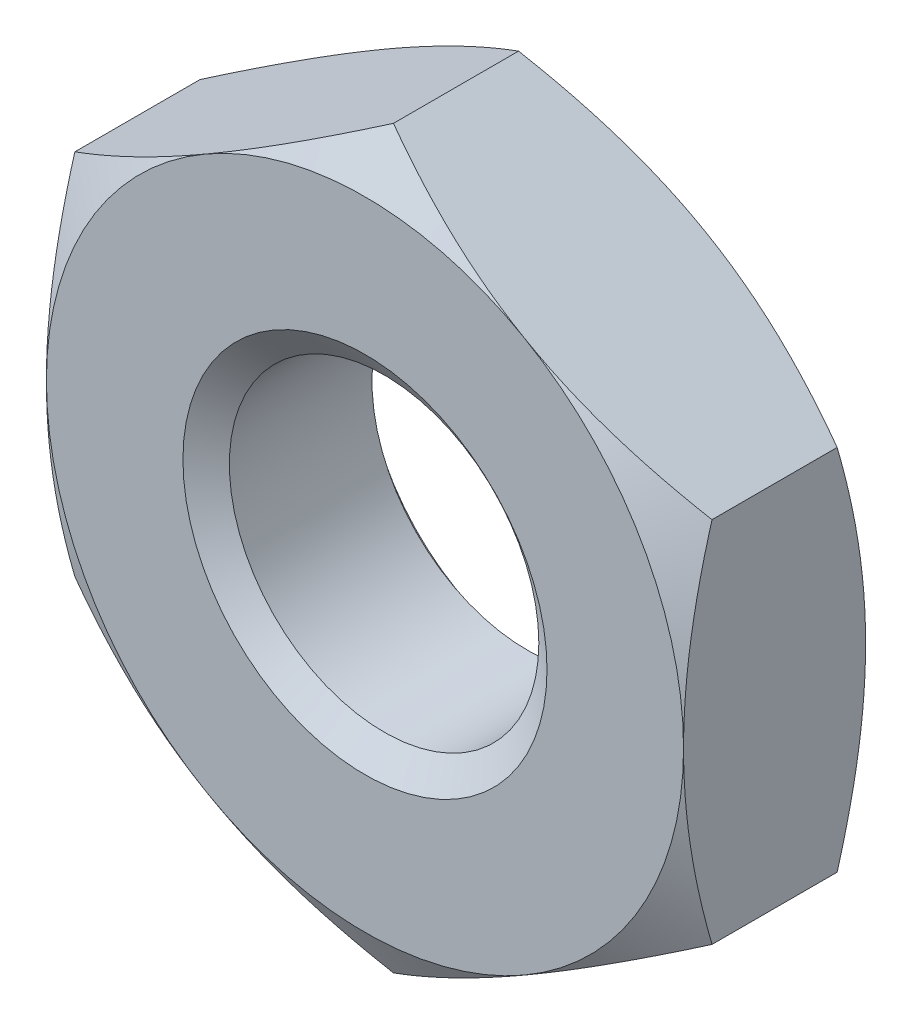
ISO-10303-21;
HEADER;
FILE_DESCRIPTION(('STEP AP214'),'2;1');
FILE_NAME('part.step','',(''),(''),'','','');
FILE_SCHEMA(('AUTOMOTIVE_DESIGN { 1 0 10303 214 1 1 1 1 }'));
ENDSEC;
DATA;
#1=APPLICATION_CONTEXT('core data for automotive mechanical design processes');
#2=APPLICATION_PROTOCOL_DEFINITION('international standard','automotive_design',2000,#1);
#3=PRODUCT_CONTEXT('',#1,'mechanical');
#4=PRODUCT('Part','Part','',(#3));
#5=PRODUCT_RELATED_PRODUCT_CATEGORY('part','',(#4));
#6=PRODUCT_DEFINITION_FORMATION('','',#4);
#7=PRODUCT_DEFINITION_CONTEXT('part definition',#1,'design');
#8=PRODUCT_DEFINITION('design','',#6,#7);
#9=PRODUCT_DEFINITION_SHAPE('','',#8);
#10=(LENGTH_UNIT() NAMED_UNIT(*) SI_UNIT(.MILLI.,.METRE.));
#11=(NAMED_UNIT(*) PLANE_ANGLE_UNIT() SI_UNIT($,.RADIAN.));
#12=(NAMED_UNIT(*) SI_UNIT($,.STERADIAN.) SOLID_ANGLE_UNIT());
#13=UNCERTAINTY_MEASURE_WITH_UNIT(LENGTH_MEASURE(1.E-05),#10,'distance_accuracy_value','');
#14=(GEOMETRIC_REPRESENTATION_CONTEXT(3) GLOBAL_UNCERTAINTY_ASSIGNED_CONTEXT((#13)) GLOBAL_UNIT_ASSIGNED_CONTEXT((#10,
#11,#12)) REPRESENTATION_CONTEXT('',''));
#15=CARTESIAN_POINT('',(0.,0.,0.));
#16=DIRECTION('',(0.,0.,1.));
#17=DIRECTION('',(1.,0.,0.));
#18=AXIS2_PLACEMENT_3D('',#15,#16,#17);
#19=CARTESIAN_POINT('',(-1.09634523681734E-12,-1.16573417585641E-12,-4.00000000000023));
#20=DIRECTION('',(0.,0.,0.999999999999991));
#21=DIRECTION('',(1.,0.,0.));
#22=AXIS2_PLACEMENT_3D('',#19,#20,#21);
#23=CYLINDRICAL_SURFACE('',#22,3.4);
#24=CARTESIAN_POINT('',(-8.74300631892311E-13,-1.55431223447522E-12,-0.420124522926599));
#25=DIRECTION('',(0.,0.,0.999999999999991));
#26=DIRECTION('',(1.,0.,0.));
#27=AXIS2_PLACEMENT_3D('',#24,#25,#26);
#28=CIRCLE('',#27,3.4);
#29=CARTESIAN_POINT('',(3.3999999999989,-1.16834734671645E-12,-0.420124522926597));
#30=VERTEX_POINT('',#29);
#31=EDGE_CURVE('E175',#30,#30,#28,.F.);
#32=CARTESIAN_POINT('',(-6.73072708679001E-13,-1.66533453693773E-13,-3.5544754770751));
#33=DIRECTION('',(0.,0.,-0.999999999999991));
#34=DIRECTION('',(-1.,0.,0.));
#35=AXIS2_PLACEMENT_3D('',#32,#33,#34);
#36=CIRCLE('',#35,3.4);
#37=CARTESIAN_POINT('',(3.39999999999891,-1.16618332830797E-12,-3.5544754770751));
#38=VERTEX_POINT('',#37);
#39=EDGE_CURVE('E39',#38,#38,#36,.F.);
#40=CARTESIAN_POINT('',(3.3999999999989,-1.16834734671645E-12,-0.420124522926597));
#41=CARTESIAN_POINT('',(3.3999999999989,-1.16832480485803E-12,-0.452774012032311));
#42=CARTESIAN_POINT('',(3.3999999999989,-1.16830226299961E-12,-0.485423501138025));
#43=CARTESIAN_POINT('',(3.3999999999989,-1.16825717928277E-12,-0.550722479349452));
#44=CARTESIAN_POINT('',(3.3999999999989,-1.16823463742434E-12,-0.583371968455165));
#45=CARTESIAN_POINT('',(3.3999999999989,-1.1681895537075E-12,-0.648670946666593));
#46=CARTESIAN_POINT('',(3.3999999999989,-1.16816701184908E-12,-0.681320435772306));
#47=CARTESIAN_POINT('',(3.3999999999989,-1.16812192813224E-12,-0.746619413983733));
#48=CARTESIAN_POINT('',(3.3999999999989,-1.16809938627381E-12,-0.779268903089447));
#49=CARTESIAN_POINT('',(3.3999999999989,-1.16805430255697E-12,-0.844567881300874));
#50=CARTESIAN_POINT('',(3.3999999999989,-1.16803176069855E-12,-0.877217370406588));
#51=CARTESIAN_POINT('',(3.3999999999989,-1.16798667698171E-12,-0.942516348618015));
#52=CARTESIAN_POINT('',(3.3999999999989,-1.16796413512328E-12,-0.975165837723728));
#53=CARTESIAN_POINT('',(3.3999999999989,-1.16791905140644E-12,-1.04046481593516));
#54=CARTESIAN_POINT('',(3.3999999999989,-1.16789650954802E-12,-1.07311430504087));
#55=CARTESIAN_POINT('',(3.3999999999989,-1.16785142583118E-12,-1.1384132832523));
#56=CARTESIAN_POINT('',(3.3999999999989,-1.16782888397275E-12,-1.17106277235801));
#57=CARTESIAN_POINT('',(3.3999999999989,-1.16778380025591E-12,-1.23636175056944));
#58=CARTESIAN_POINT('',(3.3999999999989,-1.16776125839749E-12,-1.26901123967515));
#59=CARTESIAN_POINT('',(3.3999999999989,-1.16771617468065E-12,-1.33431021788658));
#60=CARTESIAN_POINT('',(3.39999999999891,-1.16769363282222E-12,-1.36695970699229));
#61=CARTESIAN_POINT('',(3.39999999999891,-1.16764854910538E-12,-1.43225868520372));
#62=CARTESIAN_POINT('',(3.39999999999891,-1.16762600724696E-12,-1.46490817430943));
#63=CARTESIAN_POINT('',(3.39999999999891,-1.16758092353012E-12,-1.53020715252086));
#64=CARTESIAN_POINT('',(3.39999999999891,-1.16755838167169E-12,-1.56285664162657));
#65=CARTESIAN_POINT('',(3.39999999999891,-1.16751329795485E-12,-1.628155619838));
#66=CARTESIAN_POINT('',(3.39999999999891,-1.16749075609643E-12,-1.66080510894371));
#67=CARTESIAN_POINT('',(3.39999999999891,-1.16744567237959E-12,-1.72610408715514));
#68=CARTESIAN_POINT('',(3.39999999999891,-1.16742313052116E-12,-1.75875357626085));
#69=CARTESIAN_POINT('',(3.39999999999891,-1.16737804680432E-12,-1.82405255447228));
#70=CARTESIAN_POINT('',(3.39999999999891,-1.1673555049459E-12,-1.856702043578));
#71=CARTESIAN_POINT('',(3.39999999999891,-1.16731042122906E-12,-1.92200102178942));
#72=CARTESIAN_POINT('',(3.39999999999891,-1.16728787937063E-12,-1.95465051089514));
#73=CARTESIAN_POINT('',(3.39999999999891,-1.16724279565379E-12,-2.01994948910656));
#74=CARTESIAN_POINT('',(3.39999999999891,-1.16722025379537E-12,-2.05259897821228));
#75=CARTESIAN_POINT('',(3.39999999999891,-1.16717517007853E-12,-2.1178979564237));
#76=CARTESIAN_POINT('',(3.39999999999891,-1.1671526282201E-12,-2.15054744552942));
#77=CARTESIAN_POINT('',(3.39999999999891,-1.16710754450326E-12,-2.21584642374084));
#78=CARTESIAN_POINT('',(3.39999999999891,-1.16708500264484E-12,-2.24849591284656));
#79=CARTESIAN_POINT('',(3.39999999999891,-1.167039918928E-12,-2.31379489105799));
#80=CARTESIAN_POINT('',(3.39999999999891,-1.16701737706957E-12,-2.3464443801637));
#81=CARTESIAN_POINT('',(3.39999999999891,-1.16697229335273E-12,-2.41174335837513));
#82=CARTESIAN_POINT('',(3.39999999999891,-1.16694975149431E-12,-2.44439284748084));
#83=CARTESIAN_POINT('',(3.39999999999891,-1.16690466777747E-12,-2.50969182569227));
#84=CARTESIAN_POINT('',(3.39999999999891,-1.16688212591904E-12,-2.54234131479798));
#85=CARTESIAN_POINT('',(3.39999999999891,-1.1668370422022E-12,-2.60764029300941));
#86=CARTESIAN_POINT('',(3.39999999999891,-1.16681450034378E-12,-2.64028978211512));
#87=CARTESIAN_POINT('',(3.39999999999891,-1.16676941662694E-12,-2.70558876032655));
#88=CARTESIAN_POINT('',(3.39999999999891,-1.16674687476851E-12,-2.73823824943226));
#89=CARTESIAN_POINT('',(3.39999999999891,-1.16670179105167E-12,-2.80353722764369));
#90=CARTESIAN_POINT('',(3.39999999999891,-1.16667924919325E-12,-2.8361867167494));
#91=CARTESIAN_POINT('',(3.39999999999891,-1.16663416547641E-12,-2.90148569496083));
#92=CARTESIAN_POINT('',(3.39999999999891,-1.16661162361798E-12,-2.93413518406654));
#93=CARTESIAN_POINT('',(3.39999999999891,-1.16656653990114E-12,-2.99943416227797));
#94=CARTESIAN_POINT('',(3.39999999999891,-1.16654399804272E-12,-3.03208365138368));
#95=CARTESIAN_POINT('',(3.39999999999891,-1.16649891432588E-12,-3.09738262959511));
#96=CARTESIAN_POINT('',(3.39999999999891,-1.16647637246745E-12,-3.13003211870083));
#97=CARTESIAN_POINT('',(3.39999999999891,-1.16643128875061E-12,-3.19533109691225));
#98=CARTESIAN_POINT('',(3.39999999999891,-1.16640874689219E-12,-3.22798058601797));
#99=CARTESIAN_POINT('',(3.39999999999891,-1.16636366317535E-12,-3.29327956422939));
#100=CARTESIAN_POINT('',(3.39999999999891,-1.16634112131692E-12,-3.32592905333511));
#101=CARTESIAN_POINT('',(3.39999999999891,-1.16629603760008E-12,-3.39122803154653));
#102=CARTESIAN_POINT('',(3.39999999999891,-1.16627349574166E-12,-3.42387752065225));
#103=CARTESIAN_POINT('',(3.39999999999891,-1.16622841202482E-12,-3.48917649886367));
#104=CARTESIAN_POINT('',(3.39999999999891,-1.16620587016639E-12,-3.52182598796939));
#105=CARTESIAN_POINT('',(3.39999999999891,-1.16618332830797E-12,-3.5544754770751));
#106=B_SPLINE_CURVE_WITH_KNOTS('',3,(#40,#41,#42,#43,#44,#45,#46,#47,#48,#49,#50,#51,#52,#53,
#54,#55,#56,#57,#58,#59,#60,#61,#62,#63,#64,#65,#66,#67,#68,#69,#70,#71,#72,#73,#74,#75,#76,#77,
#78,#79,#80,#81,#82,#83,#84,#85,#86,#87,#88,#89,#90,#91,#92,#93,#94,#95,#96,#97,#98,#99,#100,
#101,#102,#103,#104,#105),.UNSPECIFIED.,.F.,.F.,(4,2,2,2,2,2,2,2,2,2,2,2,2,2,2,2,2,2,2,2,2,2,2,
2,2,2,2,2,2,2,2,2,4),(0.,0.0979484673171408,0.195896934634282,0.293845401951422,
0.391793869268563,0.489742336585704,0.587690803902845,0.685639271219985,0.783587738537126,
0.881536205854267,0.979484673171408,1.07743314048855,1.17538160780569,1.27333007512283,
1.37127854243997,1.46922700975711,1.56717547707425,1.66512394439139,1.76307241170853,
1.86102087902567,1.95896934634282,2.05691781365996,2.1548662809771,2.25281474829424,
2.35076321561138,2.44871168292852,2.54666015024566,2.6446086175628,2.74255708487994,
2.84050555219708,2.93845401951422,3.03640248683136,3.1343509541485),.UNSPECIFIED.);
#107=EDGE_CURVE('BSEAM34',#30,#38,#106,.T.);
#108=ORIENTED_EDGE('',*,*,#31,.F.);
#109=ORIENTED_EDGE('',*,*,#39,.F.);
#110=ORIENTED_EDGE('',*,*,#107,.T.);
#111=ORIENTED_EDGE('',*,*,#107,.F.);
#112=EDGE_LOOP('',(#108,#110,#109,#111));
#113=FACE_BOUND('',#112,.T.);
#114=ADVANCED_FACE('F34',(#113),#23,.F.);
#115=CARTESIAN_POINT('',(-14.,-2.91433543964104E-13,-4.00000000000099));
#116=DIRECTION('',(0.,0.,0.999999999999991));
#117=DIRECTION('',(1.,0.,0.));
#118=AXIS2_PLACEMENT_3D('',#115,#116,#117);
#119=PLANE('',#118);
#120=CARTESIAN_POINT('',(-1.09634523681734E-12,-1.16573417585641E-12,-4.00000000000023));
#121=DIRECTION('',(0.,0.,0.999999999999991));
#122=DIRECTION('',(1.,0.,0.));
#123=AXIS2_PLACEMENT_3D('',#120,#121,#122);
#124=CIRCLE('',#123,7.);
#125=CARTESIAN_POINT('',(6.99999999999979,0.,-4.0000000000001));
#126=VERTEX_POINT('',#125);
#127=CARTESIAN_POINT('',(3.50000000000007,6.06217782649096,-4.00000000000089));
#128=VERTEX_POINT('',#127);
#129=EDGE_CURVE('E245',#126,#128,#124,.T.);
#130=ORIENTED_EDGE('',*,*,#129,.F.);
#131=CARTESIAN_POINT('',(-1.09634523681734E-12,-1.16573417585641E-12,-4.00000000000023));
#132=DIRECTION('',(0.,0.,0.999999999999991));
#133=DIRECTION('',(1.,0.,0.));
#134=AXIS2_PLACEMENT_3D('',#131,#132,#133);
#135=CIRCLE('',#134,7.);
#136=CARTESIAN_POINT('',(3.49999999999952,-6.06217782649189,-4.00000000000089));
#137=VERTEX_POINT('',#136);
#138=EDGE_CURVE('E169',#126,#137,#135,.F.);
#139=ORIENTED_EDGE('',*,*,#138,.T.);
#140=CARTESIAN_POINT('',(-3.4999999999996,-6.06217782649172,-4.00000000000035));
#141=VERTEX_POINT('',#140);
#142=EDGE_CURVE('E171',#137,#141,#135,.F.);
#143=ORIENTED_EDGE('',*,*,#142,.T.);
#144=CARTESIAN_POINT('',(-7.00000000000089,-9.43689570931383E-13,-4.00000000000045));
#145=VERTEX_POINT('',#144);
#146=EDGE_CURVE('E402',#141,#145,#135,.F.);
#147=ORIENTED_EDGE('',*,*,#146,.T.);
#148=CARTESIAN_POINT('',(-3.50000000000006,6.06217782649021,-4.00000000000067));
#149=VERTEX_POINT('',#148);
#150=EDGE_CURVE('E404',#145,#149,#135,.F.);
#151=ORIENTED_EDGE('',*,*,#150,.T.);
#152=EDGE_CURVE('E153',#149,#128,#135,.F.);
#153=ORIENTED_EDGE('',*,*,#152,.T.);
#154=EDGE_LOOP('',(#130,#139,#143,#147,#151,#153));
#155=FACE_BOUND('',#154,.T.);
#156=CARTESIAN_POINT('',(-1.09634523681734E-12,-1.16573417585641E-12,-4.00000000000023));
#157=DIRECTION('',(0.,0.,0.999999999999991));
#158=DIRECTION('',(1.,0.,0.));
#159=AXIS2_PLACEMENT_3D('',#156,#157,#158);
#160=CIRCLE('',#159,4.);
#161=CARTESIAN_POINT('',(3.99999999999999,0.,-4.00000000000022));
#162=VERTEX_POINT('',#161);
#163=EDGE_CURVE('E178',#162,#162,#160,.F.);
#164=ORIENTED_EDGE('',*,*,#163,.F.);
#165=EDGE_LOOP('',(#164));
#166=FACE_BOUND('',#165,.T.);
#167=ADVANCED_FACE('F297',(#155,#166),#119,.F.);
#168=CARTESIAN_POINT('',(-13.9999999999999,-3.46944695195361E-13,-2.08166817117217E-13));
#169=DIRECTION('',(0.,0.,0.999999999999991));
#170=DIRECTION('',(1.,0.,0.));
#171=AXIS2_PLACEMENT_3D('',#168,#169,#170);
#172=PLANE('',#171);
#173=CARTESIAN_POINT('',(0.,0.,0.));
#174=DIRECTION('',(0.,0.,0.999999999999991));
#175=DIRECTION('',(1.,0.,0.));
#176=AXIS2_PLACEMENT_3D('',#173,#174,#175);
#177=CIRCLE('',#176,7.);
#178=CARTESIAN_POINT('',(3.49999999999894,-6.06217782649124,-5.55111512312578E-13));
#179=VERTEX_POINT('',#178);
#180=CARTESIAN_POINT('',(6.99999999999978,-2.35922392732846E-13,0.));
#181=VERTEX_POINT('',#180);
#182=EDGE_CURVE('E46',#179,#181,#177,.T.);
#183=ORIENTED_EDGE('',*,*,#182,.T.);
#184=CARTESIAN_POINT('',(0.,0.,0.));
#185=DIRECTION('',(0.,0.,0.999999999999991));
#186=DIRECTION('',(1.,0.,0.));
#187=AXIS2_PLACEMENT_3D('',#184,#185,#186);
#188=CIRCLE('',#187,7.);
#189=CARTESIAN_POINT('',(3.49999999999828,6.06217782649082,-5.68989300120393E-13));
#190=VERTEX_POINT('',#189);
#191=EDGE_CURVE('E53',#181,#190,#188,.T.);
#192=ORIENTED_EDGE('',*,*,#191,.T.);
#193=CARTESIAN_POINT('',(-3.49999999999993,6.06217782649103,0.));
#194=VERTEX_POINT('',#193);
#195=EDGE_CURVE('E11',#190,#194,#177,.T.);
#196=ORIENTED_EDGE('',*,*,#195,.T.);
#197=CARTESIAN_POINT('',(-6.99999999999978,-5.68989300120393E-13,-9.99200722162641E-13));
#198=VERTEX_POINT('',#197);
#199=EDGE_CURVE('E44',#194,#198,#177,.T.);
#200=ORIENTED_EDGE('',*,*,#199,.T.);
#201=CARTESIAN_POINT('',(-3.50000000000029,-6.06217782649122,0.));
#202=VERTEX_POINT('',#201);
#203=EDGE_CURVE('E348',#198,#202,#177,.T.);
#204=ORIENTED_EDGE('',*,*,#203,.T.);
#205=EDGE_CURVE('E174',#202,#179,#177,.T.);
#206=ORIENTED_EDGE('',*,*,#205,.T.);
#207=EDGE_LOOP('',(#183,#192,#196,#200,#204,#206));
#208=FACE_BOUND('',#207,.T.);
#209=CARTESIAN_POINT('',(0.,0.,0.));
#210=DIRECTION('',(0.,0.,0.999999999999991));
#211=DIRECTION('',(1.,0.,0.));
#212=AXIS2_PLACEMENT_3D('',#209,#210,#211);
#213=CIRCLE('',#212,4.);
#214=CARTESIAN_POINT('',(4.00000000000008,-1.80896843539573E-13,0.));
#215=VERTEX_POINT('',#214);
#216=EDGE_CURVE('E177',#215,#215,#213,.T.);
#217=ORIENTED_EDGE('',*,*,#216,.F.);
#218=EDGE_LOOP('',(#217));
#219=FACE_BOUND('',#218,.T.);
#220=ADVANCED_FACE('F250',(#208,#219),#172,.T.);
#221=CARTESIAN_POINT('',(-1.42941214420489E-12,8.08290376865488,-4.000000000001));
#222=DIRECTION('',(-0.500000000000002,0.866025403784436,0.));
#223=DIRECTION('',(-0.866025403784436,-0.500000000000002,0.));
#224=AXIS2_PLACEMENT_3D('',#221,#222,#223);
#225=PLANE('',#224);
#226=DIRECTION('',(0.,0.,0.999999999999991));
#227=VECTOR('',#226,1.);
#228=CARTESIAN_POINT('',(-7.00000000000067,4.04145188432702,-4.00000000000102));
#229=LINE('',#228,#227);
#230=CARTESIAN_POINT('',(-7.00000000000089,4.0414518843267,-3.37478521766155));
#231=VERTEX_POINT('',#230);
#232=CARTESIAN_POINT('',(-7.00000000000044,4.04145188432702,-0.625214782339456));
#233=VERTEX_POINT('',#232);
#234=EDGE_CURVE('E165',#231,#233,#229,.T.);
#235=ORIENTED_EDGE('',*,*,#234,.T.);
#236=CARTESIAN_POINT('',(-7.00020000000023,4.0413364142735,-0.625281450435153));
#237=CARTESIAN_POINT('',(-6.84633209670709,4.13017208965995,-0.573999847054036));
#238=CARTESIAN_POINT('',(-6.69189049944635,4.21933898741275,-0.525045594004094));
#239=CARTESIAN_POINT('',(-6.38175307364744,4.39839691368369,-0.432432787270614));
#240=CARTESIAN_POINT('',(-6.22605673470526,4.48828823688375,-0.388776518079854));
#241=CARTESIAN_POINT('',(-5.75647483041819,4.75940147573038,-0.26661159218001));
#242=CARTESIAN_POINT('',(-5.44073566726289,4.94169356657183,-0.197125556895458));
#243=CARTESIAN_POINT('',(-4.96823775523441,5.21449036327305,-0.115644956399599));
#244=CARTESIAN_POINT('',(-4.81289077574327,5.30417998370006,-0.0924334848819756));
#245=CARTESIAN_POINT('',(-4.50149488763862,5.48396448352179,-0.053511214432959));
#246=CARTESIAN_POINT('',(-4.34544604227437,5.57405932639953,-0.0377997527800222));
#247=CARTESIAN_POINT('',(-4.03307732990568,5.75440548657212,-0.0142779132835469));
#248=CARTESIAN_POINT('',(-3.87675797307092,5.84465650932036,-0.00645856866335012));
#249=CARTESIAN_POINT('',(-3.56398349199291,6.025236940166,0.00111975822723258));
#250=CARTESIAN_POINT('',(-3.40752837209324,6.11556634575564,0.000878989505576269));
#251=CARTESIAN_POINT('',(-2.97889312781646,6.36303901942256,-0.0108597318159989));
#252=CARTESIAN_POINT('',(-2.70685331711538,6.52010127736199,-0.0305657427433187));
#253=CARTESIAN_POINT('',(-2.16458055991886,6.83318259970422,-0.0930534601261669));
#254=CARTESIAN_POINT('',(-1.89434952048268,6.98920056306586,-0.135856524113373));
#255=CARTESIAN_POINT('',(-1.35098545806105,7.30291195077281,-0.242851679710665));
#256=CARTESIAN_POINT('',(-1.07792099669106,7.46056579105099,-0.307497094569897));
#257=CARTESIAN_POINT('',(-0.535864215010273,7.77352241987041,-0.454216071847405));
#258=CARTESIAN_POINT('',(-0.266864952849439,7.92882921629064,-0.536255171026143));
#259=CARTESIAN_POINT('',(0.000199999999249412,8.0830192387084,-0.625281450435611));
#260=B_SPLINE_CURVE_WITH_KNOTS('',3,(#236,#237,#238,#239,#240,#241,#242,#243,#244,#245,#246,
#247,#248,#249,#250,#251,#252,#253,#254,#255,#256,#257,#258,#259),.UNSPECIFIED.,.F.,.F.,(4,2,2,
2,2,2,2,2,2,2,2,4),(0.,0.554727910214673,1.10969417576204,2.22193274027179,2.76443041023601,
3.30688013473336,3.84871284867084,4.39052882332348,5.33376515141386,6.27787517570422,
7.24292418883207,8.20607866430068),.UNSPECIFIED.);
#261=EDGE_CURVE('E61',#233,#194,#260,.T.);
#262=ORIENTED_EDGE('',*,*,#261,.T.);
#263=CARTESIAN_POINT('',(-2.15105711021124E-13,8.08290376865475,-0.625214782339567));
#264=VERTEX_POINT('',#263);
#265=EDGE_CURVE('E239',#194,#264,#260,.T.);
#266=ORIENTED_EDGE('',*,*,#265,.T.);
#267=DIRECTION('',(0.,0.,0.999999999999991));
#268=VECTOR('',#267,1.);
#269=CARTESIAN_POINT('',(-1.42941214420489E-12,8.08290376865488,-4.000000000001));
#270=LINE('',#269,#268);
#271=CARTESIAN_POINT('',(-6.59194920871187E-13,8.08290376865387,-3.37478521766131));
#272=VERTEX_POINT('',#271);
#273=EDGE_CURVE('E150',#272,#264,#270,.T.);
#274=ORIENTED_EDGE('',*,*,#273,.F.);
#275=CARTESIAN_POINT('',(-7.00019999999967,4.04133641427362,-3.37471854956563));
#276=CARTESIAN_POINT('',(-6.84633209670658,4.13017208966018,-3.42600015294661));
#277=CARTESIAN_POINT('',(-6.69189049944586,4.21933898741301,-3.47495440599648));
#278=CARTESIAN_POINT('',(-6.38175307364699,4.39839691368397,-3.56756721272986));
#279=CARTESIAN_POINT('',(-6.22605673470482,4.48828823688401,-3.61122348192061));
#280=CARTESIAN_POINT('',(-5.75647483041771,4.75940147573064,-3.7333884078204));
#281=CARTESIAN_POINT('',(-5.44073566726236,4.94169356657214,-3.80287444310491));
#282=CARTESIAN_POINT('',(-4.96823775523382,5.21449036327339,-3.88435504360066));
#283=CARTESIAN_POINT('',(-4.81289077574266,5.3041799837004,-3.90756651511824));
#284=CARTESIAN_POINT('',(-4.50149488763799,5.48396448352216,-3.94648878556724));
#285=CARTESIAN_POINT('',(-4.34544604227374,5.5740593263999,-3.9622002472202));
#286=CARTESIAN_POINT('',(-4.03307732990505,5.75440548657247,-3.98572208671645));
#287=CARTESIAN_POINT('',(-3.87675797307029,5.84465650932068,-3.99354143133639));
#288=CARTESIAN_POINT('',(-3.56398349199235,6.02523694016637,-4.00111975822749));
#289=CARTESIAN_POINT('',(-3.40752837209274,6.11556634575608,-4.00087898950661));
#290=CARTESIAN_POINT('',(-2.97889312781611,6.36303901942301,-3.9891402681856));
#291=CARTESIAN_POINT('',(-2.70685331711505,6.52010127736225,-3.96943425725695));
#292=CARTESIAN_POINT('',(-2.16458055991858,6.83318259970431,-3.9069465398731));
#293=CARTESIAN_POINT('',(-1.89434952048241,6.98920056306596,-3.86414347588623));
#294=CARTESIAN_POINT('',(-1.35098545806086,7.30291195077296,-3.75714832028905));
#295=CARTESIAN_POINT('',(-1.07792099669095,7.46056579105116,-3.69250290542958));
#296=CARTESIAN_POINT('',(-0.535864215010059,7.77352241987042,-3.54578392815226));
#297=CARTESIAN_POINT('',(-0.26686495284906,7.92882921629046,-3.46374482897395));
#298=CARTESIAN_POINT('',(0.000200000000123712,8.08301923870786,-3.37471854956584));
#299=B_SPLINE_CURVE_WITH_KNOTS('',3,(#275,#276,#277,#278,#279,#280,#281,#282,#283,#284,#285,
#286,#287,#288,#289,#290,#291,#292,#293,#294,#295,#296,#297,#298),.UNSPECIFIED.,.F.,.F.,(4,2,2,
2,2,2,2,2,2,2,2,4),(0.,0.554727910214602,1.10969417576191,2.22193274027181,2.76443041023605,
3.30688013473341,3.84871284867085,4.3905288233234,5.3337651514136,6.27787517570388,
7.24292418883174,8.20607866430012),.UNSPECIFIED.);
#300=EDGE_CURVE('E168',#149,#272,#299,.T.);
#301=ORIENTED_EDGE('',*,*,#300,.F.);
#302=EDGE_CURVE('E260',#231,#149,#299,.T.);
#303=ORIENTED_EDGE('',*,*,#302,.F.);
#304=EDGE_LOOP('',(#235,#262,#266,#274,#301,#303));
#305=FACE_BOUND('',#304,.T.);
#306=ADVANCED_FACE('F36',(#305),#225,.T.);
#307=CARTESIAN_POINT('',(6.99999999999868,4.04145188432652,-4.00000000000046));
#308=DIRECTION('',(0.500000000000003,0.866025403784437,0.));
#309=DIRECTION('',(-0.866025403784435,0.5,0.));
#310=AXIS2_PLACEMENT_3D('',#307,#308,#309);
#311=PLANE('',#310);
#312=ORIENTED_EDGE('',*,*,#273,.T.);
#313=CARTESIAN_POINT('',(-0.000200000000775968,8.08301923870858,-0.625281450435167));
#314=CARTESIAN_POINT('',(0.153667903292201,7.99418356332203,-0.573999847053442));
#315=CARTESIAN_POINT('',(0.308109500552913,7.90501666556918,-0.525045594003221));
#316=CARTESIAN_POINT('',(0.618246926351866,7.72595873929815,-0.432432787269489));
#317=CARTESIAN_POINT('',(0.773943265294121,7.63606741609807,-0.388776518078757));
#318=CARTESIAN_POINT('',(1.2435251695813,7.36495417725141,-0.266611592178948));
#319=CARTESIAN_POINT('',(1.5592643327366,7.18266208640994,-0.197125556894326));
#320=CARTESIAN_POINT('',(2.03176224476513,6.90986528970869,-0.115644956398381));
#321=CARTESIAN_POINT('',(2.18710922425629,6.82017566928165,-0.0924334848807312));
#322=CARTESIAN_POINT('',(2.49850511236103,6.64039116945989,-0.0535112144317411));
#323=CARTESIAN_POINT('',(2.65455395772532,6.55029632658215,-0.0377997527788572));
#324=CARTESIAN_POINT('',(2.96692267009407,6.36995016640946,-0.0142779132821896));
#325=CARTESIAN_POINT('',(3.12324202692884,6.27969914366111,-0.00645856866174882));
#326=CARTESIAN_POINT('',(3.43601650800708,6.0991187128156,0.0011197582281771));
#327=CARTESIAN_POINT('',(3.59247162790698,6.00878930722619,0.000878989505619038));
#328=CARTESIAN_POINT('',(4.02110687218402,5.76131663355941,-0.0108597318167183));
#329=CARTESIAN_POINT('',(4.29314668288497,5.60425437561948,-0.0305657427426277));
#330=CARTESIAN_POINT('',(4.83541944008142,5.29117305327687,-0.0930534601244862));
#331=CARTESIAN_POINT('',(5.10565047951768,5.13515508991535,-0.135856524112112));
#332=CARTESIAN_POINT('',(5.64901454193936,4.82144370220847,-0.242851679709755));
#333=CARTESIAN_POINT('',(5.92207900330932,4.66378986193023,-0.307497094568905));
#334=CARTESIAN_POINT('',(6.46413578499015,4.35083323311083,-0.454216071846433));
#335=CARTESIAN_POINT('',(6.73313504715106,4.19552643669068,-0.536255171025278));
#336=CARTESIAN_POINT('',(7.00019999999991,4.04133641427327,-0.625281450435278));
#337=B_SPLINE_CURVE_WITH_KNOTS('',3,(#313,#314,#315,#316,#317,#318,#319,#320,#321,#322,#323,
#324,#325,#326,#327,#328,#329,#330,#331,#332,#333,#334,#335,#336),.UNSPECIFIED.,.F.,.F.,(4,2,2,
2,2,2,2,2,2,2,2,4),(0.,0.554727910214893,1.10969417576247,2.22193274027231,2.76443041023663,
3.30688013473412,3.84871284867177,4.39052882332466,5.33376515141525,6.2778751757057,
7.24292418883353,8.20607866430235),.UNSPECIFIED.);
#338=EDGE_CURVE('E143',#264,#190,#337,.T.);
#339=ORIENTED_EDGE('',*,*,#338,.T.);
#340=CARTESIAN_POINT('',(6.99999999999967,4.04145188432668,-0.625214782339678));
#341=VERTEX_POINT('',#340);
#342=EDGE_CURVE('E129',#190,#341,#337,.T.);
#343=ORIENTED_EDGE('',*,*,#342,.T.);
#344=DIRECTION('',(0.,0.,0.999999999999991));
#345=VECTOR('',#344,1.);
#346=CARTESIAN_POINT('',(6.99999999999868,4.04145188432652,-4.00000000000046));
#347=LINE('',#346,#345);
#348=CARTESIAN_POINT('',(6.99999999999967,4.04145188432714,-3.37478521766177));
#349=VERTEX_POINT('',#348);
#350=EDGE_CURVE('E142',#349,#341,#347,.T.);
#351=ORIENTED_EDGE('',*,*,#350,.F.);
#352=CARTESIAN_POINT('',(-0.000200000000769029,8.08301923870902,-3.3747185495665));
#353=CARTESIAN_POINT('',(0.153667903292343,7.99418356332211,-3.42600015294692));
#354=CARTESIAN_POINT('',(0.308109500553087,7.90501666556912,-3.47495440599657));
#355=CARTESIAN_POINT('',(0.618246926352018,7.72595873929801,-3.56756721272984));
#356=CARTESIAN_POINT('',(0.773943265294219,7.636067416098,-3.61122348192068));
#357=CARTESIAN_POINT('',(1.2435251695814,7.36495417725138,-3.73338840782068));
#358=CARTESIAN_POINT('',(1.55926433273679,7.18266208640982,-3.80287444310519));
#359=CARTESIAN_POINT('',(2.03176224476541,6.90986528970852,-3.88435504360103));
#360=CARTESIAN_POINT('',(2.18710922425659,6.82017566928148,-3.90756651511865));
#361=CARTESIAN_POINT('',(2.49850511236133,6.6403911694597,-3.9464887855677));
#362=CARTESIAN_POINT('',(2.65455395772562,6.55029632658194,-3.96220024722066));
#363=CARTESIAN_POINT('',(2.96692267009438,6.36995016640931,-3.98572208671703));
#364=CARTESIAN_POINT('',(3.12324202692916,6.27969914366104,-3.99354143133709));
#365=CARTESIAN_POINT('',(3.43601650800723,6.09911871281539,-4.001119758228));
#366=CARTESIAN_POINT('',(3.59247162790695,6.00878930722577,-4.0008789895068));
#367=CARTESIAN_POINT('',(4.02110687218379,5.76131663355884,-3.98914026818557));
#368=CARTESIAN_POINT('',(4.29314668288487,5.60425437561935,-3.96943425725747));
#369=CARTESIAN_POINT('',(4.83541944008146,5.29117305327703,-3.90694653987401));
#370=CARTESIAN_POINT('',(5.10565047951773,5.13515508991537,-3.86414347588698));
#371=CARTESIAN_POINT('',(5.64901454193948,4.82144370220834,-3.75714832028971));
#372=CARTESIAN_POINT('',(5.9220790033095,4.6637898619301,-3.69250290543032));
#373=CARTESIAN_POINT('',(6.46413578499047,4.35083323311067,-3.54578392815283));
#374=CARTESIAN_POINT('',(6.73313504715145,4.19552643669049,-3.46374482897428));
#375=CARTESIAN_POINT('',(7.00020000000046,4.04133641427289,-3.3747185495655));
#376=B_SPLINE_CURVE_WITH_KNOTS('',3,(#352,#353,#354,#355,#356,#357,#358,#359,#360,#361,#362,
#363,#364,#365,#366,#367,#368,#369,#370,#371,#372,#373,#374,#375),.UNSPECIFIED.,.F.,.F.,(4,2,2,
2,2,2,2,2,2,2,2,4),(0.,0.554727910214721,1.10969417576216,2.22193274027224,2.7644304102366,
3.30688013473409,3.84871284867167,4.39052882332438,5.33376515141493,6.27787517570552,
7.24292418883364,8.20607866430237),.UNSPECIFIED.);
#377=EDGE_CURVE('E254',#128,#349,#376,.T.);
#378=ORIENTED_EDGE('',*,*,#377,.F.);
#379=EDGE_CURVE('E259',#272,#128,#376,.T.);
#380=ORIENTED_EDGE('',*,*,#379,.F.);
#381=EDGE_LOOP('',(#312,#339,#343,#351,#378,#380));
#382=FACE_BOUND('',#381,.T.);
#383=ADVANCED_FACE('F140',(#382),#311,.T.);
#384=CARTESIAN_POINT('',(6.99999999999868,4.04145188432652,-4.00000000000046));
#385=DIRECTION('',(-1.,0.,0.));
#386=DIRECTION('',(0.,-0.999999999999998,0.));
#387=AXIS2_PLACEMENT_3D('',#384,#385,#386);
#388=PLANE('',#387);
#389=CARTESIAN_POINT('',(6.99999999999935,-10.718525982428,-3.34968693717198));
#390=CARTESIAN_POINT('',(6.99999999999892,-10.4111863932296,-3.20116347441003));
#391=CARTESIAN_POINT('',(6.99999999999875,-10.1031201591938,-3.05411645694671));
#392=CARTESIAN_POINT('',(6.99999999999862,-9.48514148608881,-2.76381900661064));
#393=CARTESIAN_POINT('',(6.99999999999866,-9.17522873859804,-2.62056923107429));
#394=CARTESIAN_POINT('',(6.9999999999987,-8.55148999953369,-2.33795531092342));
#395=CARTESIAN_POINT('',(6.99999999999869,-8.23765176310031,-2.19861809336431));
#396=CARTESIAN_POINT('',(6.99999999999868,-7.60739587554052,-1.92592852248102));
#397=CARTESIAN_POINT('',(6.99999999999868,-7.29097835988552,-1.79257585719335));
#398=CARTESIAN_POINT('',(6.99999999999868,-6.65113230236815,-1.53186364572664));
#399=CARTESIAN_POINT('',(6.99999999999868,-6.32766537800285,-1.40459777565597));
#400=CARTESIAN_POINT('',(6.99999999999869,-5.67691706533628,-1.16003337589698));
#401=CARTESIAN_POINT('',(6.99999999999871,-5.3496352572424,-1.04273595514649));
#402=CARTESIAN_POINT('',(6.99999999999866,-4.69140465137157,-0.821260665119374));
#403=CARTESIAN_POINT('',(6.99999999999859,-4.36046534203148,-0.717054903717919));
#404=CARTESIAN_POINT('',(6.99999999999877,-3.69389387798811,-0.525145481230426));
#405=CARTESIAN_POINT('',(6.99999999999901,-3.35826324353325,-0.437436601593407));
#406=CARTESIAN_POINT('',(6.999999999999,-2.6820238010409,-0.282785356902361));
#407=CARTESIAN_POINT('',(6.99999999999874,-2.34141369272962,-0.215848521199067));
#408=CARTESIAN_POINT('',(6.99999999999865,-1.82750129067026,-0.134373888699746));
#409=CARTESIAN_POINT('',(6.99999999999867,-1.65567653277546,-0.110369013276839));
#410=CARTESIAN_POINT('',(6.99999999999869,-1.31122142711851,-0.069141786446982));
#411=CARTESIAN_POINT('',(6.99999999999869,-1.13859116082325,-0.0519187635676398));
#412=CARTESIAN_POINT('',(6.99999999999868,-0.793853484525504,-0.0247187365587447));
#413=CARTESIAN_POINT('',(6.99999999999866,-0.621749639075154,-0.0146967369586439));
#414=CARTESIAN_POINT('',(6.9999999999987,-0.277271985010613,-0.00195174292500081));
#415=CARTESIAN_POINT('',(6.99999999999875,-0.104898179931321,0.000771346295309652));
#416=CARTESIAN_POINT('',(6.99999999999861,0.239760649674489,-0.00114636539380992));
#417=CARTESIAN_POINT('',(6.99999999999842,0.412045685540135,-0.00578509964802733));
#418=CARTESIAN_POINT('',(6.99999999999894,0.756270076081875,-0.0223111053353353));
#419=CARTESIAN_POINT('',(6.99999999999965,0.928209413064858,-0.0341987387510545));
#420=CARTESIAN_POINT('',(6.99999999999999,1.34493742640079,-0.0715474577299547));
#421=CARTESIAN_POINT('',(6.99999999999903,1.58940592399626,-0.100640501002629));
#422=CARTESIAN_POINT('',(6.99999999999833,2.0764695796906,-0.171866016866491));
#423=CARTESIAN_POINT('',(6.99999999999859,2.31906420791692,-0.21400204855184));
#424=CARTESIAN_POINT('',(6.99999999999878,2.80217998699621,-0.309819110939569));
#425=CARTESIAN_POINT('',(6.99999999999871,3.04269895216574,-0.36351105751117));
#426=CARTESIAN_POINT('',(6.99999999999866,3.52126228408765,-0.480801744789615));
#427=CARTESIAN_POINT('',(6.99999999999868,3.75930688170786,-0.544399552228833));
#428=CARTESIAN_POINT('',(6.99999999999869,4.2387844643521,-0.681642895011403));
#429=CARTESIAN_POINT('',(6.99999999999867,4.48015747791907,-0.755496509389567));
#430=CARTESIAN_POINT('',(6.99999999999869,4.96035218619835,-0.910500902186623));
#431=CARTESIAN_POINT('',(6.99999999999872,5.19917551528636,-0.991646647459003));
#432=CARTESIAN_POINT('',(6.99999999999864,5.67331254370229,-1.15955915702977));
#433=CARTESIAN_POINT('',(6.99999999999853,5.90863843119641,-1.24629171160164));
#434=CARTESIAN_POINT('',(6.99999999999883,6.37746440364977,-1.42484752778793));
#435=CARTESIAN_POINT('',(6.99999999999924,6.61096370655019,-1.51667284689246));
#436=CARTESIAN_POINT('',(7.00000000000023,6.84361473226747,-1.61054076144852));
#437=B_SPLINE_CURVE_WITH_KNOTS('',3,(#389,#390,#391,#392,#393,#394,#395,#396,#397,#398,#399,
#400,#401,#402,#403,#404,#405,#406,#407,#408,#409,#410,#411,#412,#413,#414,#415,#416,#417,#418,
#419,#420,#421,#422,#423,#424,#425,#426,#427,#428,#429,#430,#431,#432,#433,#434,#435,#436),
.UNSPECIFIED.,.F.,.F.,(4,2,2,2,2,2,2,2,2,2,2,2,2,2,2,2,2,2,2,2,2,2,2,4),(0.,1.02405063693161,
2.04827740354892,3.0783654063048,4.10839964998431,5.15107951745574,6.1938752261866,
7.2344101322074,8.27461532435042,9.31509717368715,9.83546471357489,10.35578071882,
10.8728165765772,11.3898457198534,11.9067297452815,12.4236395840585,13.1618088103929,
13.9001796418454,14.6392510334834,15.3782528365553,16.1353691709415,16.8919668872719,
17.6443059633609,18.3969512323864),.UNSPECIFIED.);
#438=CARTESIAN_POINT('',(7.00000000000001,-4.04145188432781,-0.625214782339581));
#439=VERTEX_POINT('',#438);
#440=EDGE_CURVE('E135',#439,#181,#437,.T.);
#441=ORIENTED_EDGE('',*,*,#440,.F.);
#442=DIRECTION('',(0.,0.,0.999999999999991));
#443=VECTOR('',#442,1.);
#444=CARTESIAN_POINT('',(6.99999999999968,-4.04145188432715,-4.00000000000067));
#445=LINE('',#444,#443);
#446=CARTESIAN_POINT('',(6.99999999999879,-4.04145188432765,-3.37478521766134));
#447=VERTEX_POINT('',#446);
#448=EDGE_CURVE('E151',#447,#439,#445,.T.);
#449=ORIENTED_EDGE('',*,*,#448,.F.);
#450=CARTESIAN_POINT('',(6.99999999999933,-10.7185259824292,-0.650313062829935));
#451=CARTESIAN_POINT('',(6.99999999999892,-10.4111863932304,-0.798836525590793));
#452=CARTESIAN_POINT('',(6.99999999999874,-10.1031201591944,-0.945883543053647));
#453=CARTESIAN_POINT('',(6.99999999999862,-9.48514148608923,-1.23618099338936));
#454=CARTESIAN_POINT('',(6.99999999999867,-9.17522873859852,-1.37943076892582));
#455=CARTESIAN_POINT('',(6.9999999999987,-8.55148999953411,-1.6620446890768));
#456=CARTESIAN_POINT('',(6.99999999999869,-8.23765176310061,-1.80138190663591));
#457=CARTESIAN_POINT('',(6.99999999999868,-7.60739587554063,-2.07407147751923));
#458=CARTESIAN_POINT('',(6.99999999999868,-7.29097835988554,-2.20742414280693));
#459=CARTESIAN_POINT('',(6.99999999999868,-6.65113230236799,-2.46813635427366));
#460=CARTESIAN_POINT('',(6.99999999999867,-6.32766537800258,-2.59540222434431));
#461=CARTESIAN_POINT('',(6.99999999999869,-5.67691706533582,-2.83996662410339));
#462=CARTESIAN_POINT('',(6.99999999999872,-5.34963525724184,-2.95726404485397));
#463=CARTESIAN_POINT('',(6.99999999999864,-4.69140465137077,-3.17873933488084));
#464=CARTESIAN_POINT('',(6.99999999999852,-4.36046534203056,-3.28294509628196));
#465=CARTESIAN_POINT('',(6.99999999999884,-3.69389387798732,-3.47485451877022));
#466=CARTESIAN_POINT('',(6.99999999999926,-3.35826324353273,-3.56256339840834));
#467=CARTESIAN_POINT('',(6.99999999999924,-2.68202380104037,-3.7172146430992));
#468=CARTESIAN_POINT('',(6.99999999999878,-2.34141369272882,-3.78415147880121));
#469=CARTESIAN_POINT('',(6.99999999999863,-1.82750129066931,-3.86562611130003));
#470=CARTESIAN_POINT('',(6.99999999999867,-1.6556765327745,-3.88963098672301));
#471=CARTESIAN_POINT('',(6.99999999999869,-1.31122142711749,-3.93085821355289));
#472=CARTESIAN_POINT('',(6.99999999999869,-1.1385911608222,-3.94808123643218));
#473=CARTESIAN_POINT('',(6.99999999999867,-0.793853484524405,-3.97528126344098));
#474=CARTESIAN_POINT('',(6.99999999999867,-0.621749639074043,-3.98530326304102));
#475=CARTESIAN_POINT('',(6.99999999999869,-0.277271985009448,-3.99804825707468));
#476=CARTESIAN_POINT('',(6.99999999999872,-0.104898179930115,-4.00077134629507));
#477=CARTESIAN_POINT('',(6.99999999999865,0.239760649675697,-3.99885363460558));
#478=CARTESIAN_POINT('',(6.99999999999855,0.412045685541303,-3.99421490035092));
#479=CARTESIAN_POINT('',(6.99999999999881,0.756270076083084,-3.97768889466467));
#480=CARTESIAN_POINT('',(6.99999999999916,0.928209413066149,-3.96580126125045));
#481=CARTESIAN_POINT('',(6.99999999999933,1.34493742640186,-3.92845254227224));
#482=CARTESIAN_POINT('',(6.99999999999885,1.58940592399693,-3.8993594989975));
#483=CARTESIAN_POINT('',(6.99999999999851,2.07646957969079,-3.82813398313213));
#484=CARTESIAN_POINT('',(6.99999999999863,2.31906420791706,-3.78599795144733));
#485=CARTESIAN_POINT('',(6.99999999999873,2.8021799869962,-3.69018088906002));
#486=CARTESIAN_POINT('',(6.99999999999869,3.04269895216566,-3.63648894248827));
#487=CARTESIAN_POINT('',(6.99999999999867,3.52126228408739,-3.51919825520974));
#488=CARTESIAN_POINT('',(6.99999999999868,3.75930688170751,-3.45560044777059));
#489=CARTESIAN_POINT('',(6.99999999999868,4.23878446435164,-3.31835710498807));
#490=CARTESIAN_POINT('',(6.99999999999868,4.48015747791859,-3.24450349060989));
#491=CARTESIAN_POINT('',(6.99999999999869,4.96035218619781,-3.08949909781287));
#492=CARTESIAN_POINT('',(6.9999999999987,5.19917551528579,-3.00835335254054));
#493=CARTESIAN_POINT('',(6.99999999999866,5.67331254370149,-2.84044084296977));
#494=CARTESIAN_POINT('',(6.99999999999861,5.90863843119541,-2.75370828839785));
#495=CARTESIAN_POINT('',(6.99999999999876,6.37746440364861,-2.57515247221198));
#496=CARTESIAN_POINT('',(6.99999999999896,6.61096370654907,-2.48332715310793));
#497=CARTESIAN_POINT('',(6.99999999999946,6.84361473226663,-2.38945923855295));
#498=B_SPLINE_CURVE_WITH_KNOTS('',3,(#450,#451,#452,#453,#454,#455,#456,#457,#458,#459,#460,
#461,#462,#463,#464,#465,#466,#467,#468,#469,#470,#471,#472,#473,#474,#475,#476,#477,#478,#479,
#480,#481,#482,#483,#484,#485,#486,#487,#488,#489,#490,#491,#492,#493,#494,#495,#496,#497),
.UNSPECIFIED.,.F.,.F.,(4,2,2,2,2,2,2,2,2,2,2,2,2,2,2,2,2,2,2,2,2,2,2,4),(0.,1.02405063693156,
2.04827740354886,3.07836540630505,4.10839964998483,5.15107951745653,6.19387522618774,
7.23441013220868,8.27461532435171,9.31509717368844,9.83546471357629,10.3557807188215,
10.8728165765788,11.389845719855,11.9067297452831,12.42363958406,13.1618088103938,
13.900179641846,14.6392510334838,15.3782528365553,16.1353691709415,16.8919668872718,
17.6443059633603,18.3969512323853),.UNSPECIFIED.);
#499=EDGE_CURVE('E265',#447,#126,#498,.T.);
#500=ORIENTED_EDGE('',*,*,#499,.T.);
#501=EDGE_CURVE('E149',#126,#349,#498,.T.);
#502=ORIENTED_EDGE('',*,*,#501,.T.);
#503=ORIENTED_EDGE('',*,*,#350,.T.);
#504=EDGE_CURVE('E126',#181,#341,#437,.T.);
#505=ORIENTED_EDGE('',*,*,#504,.F.);
#506=EDGE_LOOP('',(#441,#449,#500,#502,#503,#505));
#507=FACE_BOUND('',#506,.T.);
#508=ADVANCED_FACE('F146',(#507),#388,.F.);
#509=CARTESIAN_POINT('',(-2.22044604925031E-13,-8.08290376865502,-4.00000000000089));
#510=DIRECTION('',(0.500000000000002,-0.866025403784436,0.));
#511=DIRECTION('',(0.866025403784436,0.500000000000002,0.));
#512=AXIS2_PLACEMENT_3D('',#509,#510,#511);
#513=PLANE('',#512);
#514=ORIENTED_EDGE('',*,*,#448,.T.);
#515=CARTESIAN_POINT('',(7.0001999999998,-4.04133641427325,-0.625281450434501));
#516=CARTESIAN_POINT('',(6.84633209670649,-4.1301720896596,-0.573999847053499));
#517=CARTESIAN_POINT('',(6.69189049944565,-4.21933898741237,-0.525045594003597));
#518=CARTESIAN_POINT('',(6.38175307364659,-4.39839691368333,-0.432432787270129));
#519=CARTESIAN_POINT('',(6.22605673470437,-4.48828823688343,-0.388776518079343));
#520=CARTESIAN_POINT('',(5.75647483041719,-4.75940147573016,-0.266611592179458));
#521=CARTESIAN_POINT('',(5.44073566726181,-4.94169356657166,-0.197125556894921));
#522=CARTESIAN_POINT('',(4.96823775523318,-5.21449036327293,-0.115644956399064));
#523=CARTESIAN_POINT('',(4.81289077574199,-5.30417998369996,-0.0924334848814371));
#524=CARTESIAN_POINT('',(4.50149488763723,-5.48396448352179,-0.0535112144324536));
#525=CARTESIAN_POINT('',(4.34544604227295,-5.5740593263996,-0.0377997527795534));
#526=CARTESIAN_POINT('',(4.03307732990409,-5.75440548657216,-0.0142779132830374));
#527=CARTESIAN_POINT('',(3.8767579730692,-5.8446565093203,-0.00645856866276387));
#528=CARTESIAN_POINT('',(3.56398349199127,-6.02523694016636,0.00111975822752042));
#529=CARTESIAN_POINT('',(3.4075283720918,-6.11556634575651,0.000878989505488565));
#530=CARTESIAN_POINT('',(2.97889312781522,-6.36303901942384,-0.0108597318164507));
#531=CARTESIAN_POINT('',(2.70685331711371,-6.52010127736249,-0.0305657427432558));
#532=CARTESIAN_POINT('',(2.16458055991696,-6.83318259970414,-0.0930534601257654));
#533=CARTESIAN_POINT('',(1.89434952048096,-6.98920056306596,-0.135856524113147));
#534=CARTESIAN_POINT('',(1.35098545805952,-7.30291195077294,-0.242851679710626));
#535=CARTESIAN_POINT('',(1.07792099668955,-7.46056579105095,-0.307497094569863));
#536=CARTESIAN_POINT('',(0.535864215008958,-7.77352241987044,-0.454216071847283));
#537=CARTESIAN_POINT('',(0.266864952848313,-7.92882921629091,-0.53625517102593));
#538=CARTESIAN_POINT('',(-0.00019999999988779,-8.08301923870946,-0.625281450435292));
#539=B_SPLINE_CURVE_WITH_KNOTS('',3,(#515,#516,#517,#518,#519,#520,#521,#522,#523,#524,#525,
#526,#527,#528,#529,#530,#531,#532,#533,#534,#535,#536,#537,#538),.UNSPECIFIED.,.F.,.F.,(4,2,2,
2,2,2,2,2,2,2,2,4),(0.,0.554727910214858,1.10969417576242,2.22193274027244,2.76443041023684,
3.30688013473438,3.84871284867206,4.39052882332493,5.33376515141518,6.27787517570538,
7.24292418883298,8.20607866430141),.UNSPECIFIED.);
#540=EDGE_CURVE('E336',#439,#179,#539,.T.);
#541=ORIENTED_EDGE('',*,*,#540,.T.);
#542=CARTESIAN_POINT('',(-5.34294830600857E-13,-8.08290376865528,-0.625214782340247));
#543=VERTEX_POINT('',#542);
#544=EDGE_CURVE('E226',#179,#543,#539,.T.);
#545=ORIENTED_EDGE('',*,*,#544,.T.);
#546=DIRECTION('',(0.,0.,0.999999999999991));
#547=VECTOR('',#546,1.);
#548=CARTESIAN_POINT('',(-2.22044604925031E-13,-8.08290376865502,-4.00000000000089));
#549=LINE('',#548,#547);
#550=CARTESIAN_POINT('',(-8.67361737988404E-13,-8.08290376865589,-3.3747852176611));
#551=VERTEX_POINT('',#550);
#552=EDGE_CURVE('E156',#551,#543,#549,.T.);
#553=ORIENTED_EDGE('',*,*,#552,.F.);
#554=CARTESIAN_POINT('',(7.00019999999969,-4.04133641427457,-3.37471854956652));
#555=CARTESIAN_POINT('',(6.84633209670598,-4.13017208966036,-3.42600015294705));
#556=CARTESIAN_POINT('',(6.69189049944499,-4.21933898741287,-3.47495440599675));
#557=CARTESIAN_POINT('',(6.3817530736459,-4.39839691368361,-3.56756721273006));
#558=CARTESIAN_POINT('',(6.22605673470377,-4.48828823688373,-3.61122348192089));
#559=CARTESIAN_POINT('',(5.75647483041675,-4.7594014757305,-3.73338840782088));
#560=CARTESIAN_POINT('',(5.44073566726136,-4.94169356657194,-3.8028744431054));
#561=CARTESIAN_POINT('',(4.96823775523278,-5.21449036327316,-3.88435504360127));
#562=CARTESIAN_POINT('',(4.81289077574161,-5.30417998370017,-3.9075665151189));
#563=CARTESIAN_POINT('',(4.50149488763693,-5.48396448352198,-3.94648878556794));
#564=CARTESIAN_POINT('',(4.34544604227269,-5.57405932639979,-3.9622002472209));
#565=CARTESIAN_POINT('',(4.03307732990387,-5.75440548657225,-3.98572208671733));
#566=CARTESIAN_POINT('',(3.87675797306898,-5.8446565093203,-3.99354143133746));
#567=CARTESIAN_POINT('',(3.56398349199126,-6.02523694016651,-4.00111975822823));
#568=CARTESIAN_POINT('',(3.40752837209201,-6.11556634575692,-4.00087898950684));
#569=CARTESIAN_POINT('',(2.9788931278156,-6.36303901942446,-3.98914026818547));
#570=CARTESIAN_POINT('',(2.70685331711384,-6.52010127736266,-3.96943425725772));
#571=CARTESIAN_POINT('',(2.16458055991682,-6.83318259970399,-3.90694653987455));
#572=CARTESIAN_POINT('',(1.89434952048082,-6.98920056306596,-3.86414347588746));
#573=CARTESIAN_POINT('',(1.35098545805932,-7.30291195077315,-3.7571483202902));
#574=CARTESIAN_POINT('',(1.0779209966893,-7.46056579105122,-3.69250290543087));
#575=CARTESIAN_POINT('',(0.535864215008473,-7.77352241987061,-3.54578392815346));
#576=CARTESIAN_POINT('',(0.26686495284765,-7.92882921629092,-3.46374482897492));
#577=CARTESIAN_POINT('',(-0.000200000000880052,-8.08301923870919,-3.37471854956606));
#578=B_SPLINE_CURVE_WITH_KNOTS('',3,(#554,#555,#556,#557,#558,#559,#560,#561,#562,#563,#564,
#565,#566,#567,#568,#569,#570,#571,#572,#573,#574,#575,#576,#577),.UNSPECIFIED.,.F.,.F.,(4,2,2,
2,2,2,2,2,2,2,2,4),(0.,0.554727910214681,1.10969417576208,2.221932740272,2.7644304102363,
3.30688013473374,3.84871284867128,4.39052882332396,5.33376515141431,6.27787517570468,
7.24292418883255,8.20607866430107),.UNSPECIFIED.);
#579=EDGE_CURVE('E271',#137,#551,#578,.T.);
#580=ORIENTED_EDGE('',*,*,#579,.F.);
#581=EDGE_CURVE('E270',#447,#137,#578,.T.);
#582=ORIENTED_EDGE('',*,*,#581,.F.);
#583=EDGE_LOOP('',(#514,#541,#545,#553,#580,#582));
#584=FACE_BOUND('',#583,.T.);
#585=ADVANCED_FACE('F281',(#584),#513,.T.);
#586=CARTESIAN_POINT('',(-7.00000000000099,-4.04145188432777,-4.00000000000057));
#587=DIRECTION('',(-0.500000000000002,-0.866025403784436,0.));
#588=DIRECTION('',(0.866025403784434,-0.5,0.));
#589=AXIS2_PLACEMENT_3D('',#586,#587,#588);
#590=PLANE('',#589);
#591=ORIENTED_EDGE('',*,*,#552,.T.);
#592=CARTESIAN_POINT('',(0.000199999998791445,-8.08301923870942,-0.625281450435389));
#593=CARTESIAN_POINT('',(-0.153667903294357,-7.99418356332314,-0.573999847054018));
#594=CARTESIAN_POINT('',(-0.308109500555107,-7.90501666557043,-0.525045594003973));
#595=CARTESIAN_POINT('',(-0.618246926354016,-7.72595873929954,-0.432432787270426));
#596=CARTESIAN_POINT('',(-0.773943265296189,-7.63606741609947,-0.388776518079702));
#597=CARTESIAN_POINT('',(-1.2435251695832,-7.36495417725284,-0.266611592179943));
#598=CARTESIAN_POINT('',(-1.55926433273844,-7.18266208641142,-0.1971255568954));
#599=CARTESIAN_POINT('',(-2.03176224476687,-6.90986528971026,-0.115644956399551));
#600=CARTESIAN_POINT('',(-2.18710922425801,-6.82017566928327,-0.0924334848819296));
#601=CARTESIAN_POINT('',(-2.49850511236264,-6.6403911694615,-0.0535112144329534));
#602=CARTESIAN_POINT('',(-2.65455395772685,-6.55029632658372,-0.0377997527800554));
#603=CARTESIAN_POINT('',(-2.96692267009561,-6.36995016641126,-0.0142779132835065));
#604=CARTESIAN_POINT('',(-3.12324202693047,-6.2796991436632,-0.00645856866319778));
#605=CARTESIAN_POINT('',(-3.43601650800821,-6.09911871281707,0.0011197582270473));
#606=CARTESIAN_POINT('',(-3.59247162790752,-6.00878930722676,0.000878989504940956));
#607=CARTESIAN_POINT('',(-4.02110687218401,-5.76131663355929,-0.0108597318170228));
#608=CARTESIAN_POINT('',(-4.29314668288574,-5.6042543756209,-0.030565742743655));
#609=CARTESIAN_POINT('',(-4.83541944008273,-5.29117305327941,-0.0930534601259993));
#610=CARTESIAN_POINT('',(-5.10565047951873,-5.13515508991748,-0.135856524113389));
#611=CARTESIAN_POINT('',(-5.64901454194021,-4.82144370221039,-0.242851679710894));
#612=CARTESIAN_POINT('',(-5.92207900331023,-4.66378986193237,-0.30749709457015));
#613=CARTESIAN_POINT('',(-6.46413578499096,-4.35083323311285,-0.454216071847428));
#614=CARTESIAN_POINT('',(-6.73313504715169,-4.19552643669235,-0.536255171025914));
#615=CARTESIAN_POINT('',(-7.0002,-4.04133641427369,-0.625281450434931));
#616=B_SPLINE_CURVE_WITH_KNOTS('',3,(#592,#593,#594,#595,#596,#597,#598,#599,#600,#601,#602,
#603,#604,#605,#606,#607,#608,#609,#610,#611,#612,#613,#614,#615),.UNSPECIFIED.,.F.,.F.,(4,2,2,
2,2,2,2,2,2,2,2,4),(0.,0.554727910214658,1.109694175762,2.22193274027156,2.76443041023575,
3.30688013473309,3.84871284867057,4.39052882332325,5.33376515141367,6.27787517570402,
7.24292418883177,8.20607866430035),.UNSPECIFIED.);
#617=EDGE_CURVE('E339',#543,#202,#616,.T.);
#618=ORIENTED_EDGE('',*,*,#617,.T.);
#619=CARTESIAN_POINT('',(-7.0000000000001,-4.04145188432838,-0.625214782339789));
#620=VERTEX_POINT('',#619);
#621=EDGE_CURVE('E199',#202,#620,#616,.T.);
#622=ORIENTED_EDGE('',*,*,#621,.T.);
#623=DIRECTION('',(0.,0.,0.999999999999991));
#624=VECTOR('',#623,1.);
#625=CARTESIAN_POINT('',(-7.00000000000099,-4.04145188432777,-4.00000000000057));
#626=LINE('',#625,#624);
#627=CARTESIAN_POINT('',(-7.000000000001,-4.04145188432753,-3.37478521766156));
#628=VERTEX_POINT('',#627);
#629=EDGE_CURVE('E162',#628,#620,#626,.T.);
#630=ORIENTED_EDGE('',*,*,#629,.F.);
#631=CARTESIAN_POINT('',(0.00020000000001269,-8.08301923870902,-3.3747185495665));
#632=CARTESIAN_POINT('',(-0.153667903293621,-7.99418356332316,-3.42600015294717));
#633=CARTESIAN_POINT('',(-0.308109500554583,-7.90501666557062,-3.47495440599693));
#634=CARTESIAN_POINT('',(-0.61824692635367,-7.72595873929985,-3.5675672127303));
#635=CARTESIAN_POINT('',(-0.77394326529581,-7.63606741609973,-3.61122348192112));
#636=CARTESIAN_POINT('',(-1.24352516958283,-7.36495417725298,-3.73338840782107));
#637=CARTESIAN_POINT('',(-1.55926433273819,-7.18266208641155,-3.8028744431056));
#638=CARTESIAN_POINT('',(-2.03176224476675,-6.90986528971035,-3.88435504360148));
#639=CARTESIAN_POINT('',(-2.18710922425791,-6.82017566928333,-3.90756651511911));
#640=CARTESIAN_POINT('',(-2.4985051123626,-6.64039116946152,-3.94648878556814));
#641=CARTESIAN_POINT('',(-2.65455395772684,-6.55029632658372,-3.96220024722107));
#642=CARTESIAN_POINT('',(-2.96692267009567,-6.36995016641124,-3.98572208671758));
#643=CARTESIAN_POINT('',(-3.12324202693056,-6.27969914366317,-3.99354143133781));
#644=CARTESIAN_POINT('',(-3.43601650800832,-6.09911871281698,-4.0011197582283));
#645=CARTESIAN_POINT('',(-3.59247162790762,-6.00878930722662,-4.00087898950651));
#646=CARTESIAN_POINT('',(-4.02110687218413,-5.76131663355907,-3.98914026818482));
#647=CARTESIAN_POINT('',(-4.29314668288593,-5.60425437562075,-3.96943425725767));
#648=CARTESIAN_POINT('',(-4.83541944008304,-5.29117305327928,-3.90694653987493));
#649=CARTESIAN_POINT('',(-5.10565047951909,-5.13515508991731,-3.86414347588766));
#650=CARTESIAN_POINT('',(-5.64901454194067,-4.8214437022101,-3.75714832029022));
#651=CARTESIAN_POINT('',(-5.92207900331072,-4.663789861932,-3.6925029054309));
#652=CARTESIAN_POINT('',(-6.46413578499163,-4.35083323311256,-3.5457839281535));
#653=CARTESIAN_POINT('',(-6.73313504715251,-4.19552643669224,-3.46374482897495));
#654=CARTESIAN_POINT('',(-7.00020000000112,-4.04133641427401,-3.37471854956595));
#655=B_SPLINE_CURVE_WITH_KNOTS('',3,(#631,#632,#633,#634,#635,#636,#637,#638,#639,#640,#641,
#642,#643,#644,#645,#646,#647,#648,#649,#650,#651,#652,#653,#654),.UNSPECIFIED.,.F.,.F.,(4,2,2,
2,2,2,2,2,2,2,2,4),(0.,0.554727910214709,1.10969417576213,2.22193274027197,2.76443041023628,
3.30688013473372,3.84871284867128,4.39052882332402,5.33376515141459,6.27787517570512,
7.2429241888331,8.20607866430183),.UNSPECIFIED.);
#656=EDGE_CURVE('E277',#141,#628,#655,.T.);
#657=ORIENTED_EDGE('',*,*,#656,.F.);
#658=EDGE_CURVE('E276',#551,#141,#655,.T.);
#659=ORIENTED_EDGE('',*,*,#658,.F.);
#660=EDGE_LOOP('',(#591,#618,#622,#630,#657,#659));
#661=FACE_BOUND('',#660,.T.);
#662=ADVANCED_FACE('F284',(#661),#590,.T.);
#663=CARTESIAN_POINT('',(-7.00000000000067,4.04145188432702,-4.00000000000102));
#664=DIRECTION('',(-1.,0.,0.));
#665=DIRECTION('',(0.,-0.999999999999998,0.));
#666=AXIS2_PLACEMENT_3D('',#663,#664,#665);
#667=PLANE('',#666);
#668=ORIENTED_EDGE('',*,*,#629,.T.);
#669=CARTESIAN_POINT('',(-7.00000000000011,-10.7185259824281,-3.3496869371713));
#670=CARTESIAN_POINT('',(-7.00000000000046,-10.4111863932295,-3.20116347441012));
#671=CARTESIAN_POINT('',(-7.0000000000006,-10.1031201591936,-3.05411645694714));
#672=CARTESIAN_POINT('',(-7.0000000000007,-9.48514148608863,-2.76381900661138));
#673=CARTESIAN_POINT('',(-7.00000000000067,-9.17522873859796,-2.62056923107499));
#674=CARTESIAN_POINT('',(-7.00000000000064,-8.55148999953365,-2.33795531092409));
#675=CARTESIAN_POINT('',(-7.00000000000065,-8.23765176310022,-2.19861809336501));
#676=CARTESIAN_POINT('',(-7.00000000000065,-7.60739587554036,-1.92592852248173));
#677=CARTESIAN_POINT('',(-7.00000000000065,-7.29097835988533,-1.79257585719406));
#678=CARTESIAN_POINT('',(-7.00000000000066,-6.65113230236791,-1.53186364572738));
#679=CARTESIAN_POINT('',(-7.00000000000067,-6.32766537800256,-1.40459777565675));
#680=CARTESIAN_POINT('',(-7.00000000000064,-5.67691706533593,-1.16003337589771));
#681=CARTESIAN_POINT('',(-7.0000000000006,-5.34963525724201,-1.04273595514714));
#682=CARTESIAN_POINT('',(-7.00000000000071,-4.69140465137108,-0.82126066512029));
#683=CARTESIAN_POINT('',(-7.00000000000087,-4.36046534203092,-0.717054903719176));
#684=CARTESIAN_POINT('',(-7.00000000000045,-3.69389387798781,-0.525145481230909));
#685=CARTESIAN_POINT('',(-6.99999999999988,-3.35826324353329,-0.437436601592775));
#686=CARTESIAN_POINT('',(-6.99999999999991,-2.68202380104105,-0.282785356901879));
#687=CARTESIAN_POINT('',(-7.00000000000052,-2.34141369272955,-0.215848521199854));
#688=CARTESIAN_POINT('',(-7.00000000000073,-1.82750129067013,-0.13437388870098));
#689=CARTESIAN_POINT('',(-7.00000000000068,-1.65567653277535,-0.11036901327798));
#690=CARTESIAN_POINT('',(-7.00000000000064,-1.3112214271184,-0.0691417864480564));
#691=CARTESIAN_POINT('',(-7.00000000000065,-1.13859116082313,-0.0519187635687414));
#692=CARTESIAN_POINT('',(-7.00000000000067,-0.793853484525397,-0.0247187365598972));
#693=CARTESIAN_POINT('',(-7.00000000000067,-0.621749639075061,-0.0146967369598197));
#694=CARTESIAN_POINT('',(-7.00000000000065,-0.277271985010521,-0.0019517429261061));
#695=CARTESIAN_POINT('',(-7.00000000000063,-0.104898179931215,0.000771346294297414));
#696=CARTESIAN_POINT('',(-7.00000000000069,0.239760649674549,-0.00114636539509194));
#697=CARTESIAN_POINT('',(-7.00000000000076,0.412045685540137,-0.0057850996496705));
#698=CARTESIAN_POINT('',(-7.00000000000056,0.75627007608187,-0.0223111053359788));
#699=CARTESIAN_POINT('',(-7.00000000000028,0.928209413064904,-0.0341987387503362));
#700=CARTESIAN_POINT('',(-7.00000000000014,1.34493742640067,-0.0715474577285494));
#701=CARTESIAN_POINT('',(-7.00000000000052,1.58940592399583,-0.100640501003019));
#702=CARTESIAN_POINT('',(-7.0000000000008,2.07646957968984,-0.171866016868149));
#703=CARTESIAN_POINT('',(-7.0000000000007,2.31906420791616,-0.214002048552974));
#704=CARTESIAN_POINT('',(-7.00000000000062,2.80217998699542,-0.309819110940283));
#705=CARTESIAN_POINT('',(-7.00000000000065,3.04269895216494,-0.363511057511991));
#706=CARTESIAN_POINT('',(-7.00000000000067,3.52126228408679,-0.480801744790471));
#707=CARTESIAN_POINT('',(-7.00000000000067,3.75930688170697,-0.544399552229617));
#708=CARTESIAN_POINT('',(-7.00000000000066,4.23878446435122,-0.68164289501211));
#709=CARTESIAN_POINT('',(-7.00000000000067,4.48015747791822,-0.755496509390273));
#710=CARTESIAN_POINT('',(-7.00000000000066,4.96035218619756,-0.910500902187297));
#711=CARTESIAN_POINT('',(-7.00000000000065,5.19917551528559,-0.991646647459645));
#712=CARTESIAN_POINT('',(-7.00000000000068,5.67331254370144,-1.15955915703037));
#713=CARTESIAN_POINT('',(-7.00000000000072,5.90863843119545,-1.24629171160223));
#714=CARTESIAN_POINT('',(-7.00000000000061,6.37746440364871,-1.42484752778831));
#715=CARTESIAN_POINT('',(-7.00000000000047,6.61096370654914,-1.51667284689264));
#716=CARTESIAN_POINT('',(-7.00000000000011,6.84361473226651,-1.61054076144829));
#717=B_SPLINE_CURVE_WITH_KNOTS('',3,(#669,#670,#671,#672,#673,#674,#675,#676,#677,#678,#679,
#680,#681,#682,#683,#684,#685,#686,#687,#688,#689,#690,#691,#692,#693,#694,#695,#696,#697,#698,
#699,#700,#701,#702,#703,#704,#705,#706,#707,#708,#709,#710,#711,#712,#713,#714,#715,#716),
.UNSPECIFIED.,.F.,.F.,(4,2,2,2,2,2,2,2,2,2,2,2,2,2,2,2,2,2,2,2,2,2,2,4),(0.,1.02405063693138,
2.04827740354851,3.07836540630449,4.10839964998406,5.15107951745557,6.19387522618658,
7.23441013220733,8.27461532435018,9.31509717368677,9.83546471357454,10.3557807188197,
10.8728165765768,11.389845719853,11.9067297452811,12.4236395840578,13.1618088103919,
13.9001796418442,14.6392510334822,15.3782528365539,16.1353691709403,16.8919668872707,
17.6443059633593,18.3969512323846),.UNSPECIFIED.);
#718=EDGE_CURVE('E198',#620,#198,#717,.T.);
#719=ORIENTED_EDGE('',*,*,#718,.T.);
#720=EDGE_CURVE('E192',#198,#233,#717,.T.);
#721=ORIENTED_EDGE('',*,*,#720,.T.);
#722=ORIENTED_EDGE('',*,*,#234,.F.);
#723=CARTESIAN_POINT('',(-7.00000000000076,-10.7185259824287,-0.650313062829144));
#724=CARTESIAN_POINT('',(-7.00000000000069,-10.4111863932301,-0.798836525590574));
#725=CARTESIAN_POINT('',(-7.00000000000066,-10.1031201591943,-0.94588354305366));
#726=CARTESIAN_POINT('',(-7.00000000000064,-9.48514148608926,-1.23618099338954));
#727=CARTESIAN_POINT('',(-7.00000000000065,-9.17522873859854,-1.37943076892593));
#728=CARTESIAN_POINT('',(-7.00000000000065,-8.55148999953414,-1.66204468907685));
#729=CARTESIAN_POINT('',(-7.00000000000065,-8.23765176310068,-1.80138190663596));
#730=CARTESIAN_POINT('',(-7.00000000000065,-7.60739587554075,-2.07407147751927));
#731=CARTESIAN_POINT('',(-7.00000000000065,-7.29097835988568,-2.20742414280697));
#732=CARTESIAN_POINT('',(-7.00000000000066,-6.65113230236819,-2.46813635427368));
#733=CARTESIAN_POINT('',(-7.00000000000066,-6.32766537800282,-2.59540222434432));
#734=CARTESIAN_POINT('',(-7.00000000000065,-5.67691706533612,-2.83996662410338));
#735=CARTESIAN_POINT('',(-7.00000000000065,-5.34963525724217,-2.95726404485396));
#736=CARTESIAN_POINT('',(-7.00000000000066,-4.69140465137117,-3.17873933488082));
#737=CARTESIAN_POINT('',(-7.00000000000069,-4.36046534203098,-3.28294509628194));
#738=CARTESIAN_POINT('',(-7.00000000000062,-3.6938938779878,-3.47485451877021));
#739=CARTESIAN_POINT('',(-7.00000000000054,-3.35826324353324,-3.56256339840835));
#740=CARTESIAN_POINT('',(-7.00000000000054,-2.68202380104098,-3.71721464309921));
#741=CARTESIAN_POINT('',(-7.00000000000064,-2.34141369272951,-3.7841514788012));
#742=CARTESIAN_POINT('',(-7.00000000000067,-1.82750129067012,-3.86562611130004));
#743=CARTESIAN_POINT('',(-7.00000000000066,-1.65567653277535,-3.88963098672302));
#744=CARTESIAN_POINT('',(-7.00000000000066,-1.31122142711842,-3.93085821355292));
#745=CARTESIAN_POINT('',(-7.00000000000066,-1.13859116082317,-3.94808123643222));
#746=CARTESIAN_POINT('',(-7.00000000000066,-0.793853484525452,-3.97528126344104));
#747=CARTESIAN_POINT('',(-7.00000000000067,-0.621749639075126,-3.9853032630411));
#748=CARTESIAN_POINT('',(-7.00000000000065,-0.277271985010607,-3.99804825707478));
#749=CARTESIAN_POINT('',(-7.00000000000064,-0.104898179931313,-4.00077134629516));
#750=CARTESIAN_POINT('',(-7.00000000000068,0.239760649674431,-3.99885363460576));
#751=CARTESIAN_POINT('',(-7.00000000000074,0.41204568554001,-3.99421490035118));
#752=CARTESIAN_POINT('',(-7.00000000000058,0.756270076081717,-3.97768889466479));
#753=CARTESIAN_POINT('',(-7.00000000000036,0.928209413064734,-3.96580126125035));
#754=CARTESIAN_POINT('',(-7.00000000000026,1.34493742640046,-3.92845254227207));
#755=CARTESIAN_POINT('',(-7.00000000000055,1.58940592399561,-3.89935949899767));
#756=CARTESIAN_POINT('',(-7.00000000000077,2.07646957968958,-3.82813398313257));
#757=CARTESIAN_POINT('',(-7.00000000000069,2.31906420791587,-3.7859979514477));
#758=CARTESIAN_POINT('',(-7.00000000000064,2.80217998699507,-3.69018088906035));
#759=CARTESIAN_POINT('',(-7.00000000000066,3.04269895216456,-3.63648894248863));
#760=CARTESIAN_POINT('',(-7.00000000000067,3.52126228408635,-3.51919825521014));
#761=CARTESIAN_POINT('',(-7.00000000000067,3.7593068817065,-3.45560044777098));
#762=CARTESIAN_POINT('',(-7.00000000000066,4.23878446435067,-3.31835710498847));
#763=CARTESIAN_POINT('',(-7.00000000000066,4.48015747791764,-3.2445034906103));
#764=CARTESIAN_POINT('',(-7.00000000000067,4.9603521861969,-3.08949909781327));
#765=CARTESIAN_POINT('',(-7.00000000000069,5.19917551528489,-3.00835335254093));
#766=CARTESIAN_POINT('',(-7.00000000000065,5.67331254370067,-2.8404408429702));
#767=CARTESIAN_POINT('',(-7.00000000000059,5.90863843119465,-2.75370828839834));
#768=CARTESIAN_POINT('',(-7.00000000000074,6.37746440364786,-2.57515247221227));
#769=CARTESIAN_POINT('',(-7.00000000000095,6.61096370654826,-2.48332715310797));
#770=CARTESIAN_POINT('',(-7.00000000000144,6.84361473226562,-2.38945923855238));
#771=B_SPLINE_CURVE_WITH_KNOTS('',3,(#723,#724,#725,#726,#727,#728,#729,#730,#731,#732,#733,
#734,#735,#736,#737,#738,#739,#740,#741,#742,#743,#744,#745,#746,#747,#748,#749,#750,#751,#752,
#753,#754,#755,#756,#757,#758,#759,#760,#761,#762,#763,#764,#765,#766,#767,#768,#769,#770),
.UNSPECIFIED.,.F.,.F.,(4,2,2,2,2,2,2,2,2,2,2,2,2,2,2,2,2,2,2,2,2,2,2,4),(0.,1.02405063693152,
2.04827740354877,3.07836540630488,4.10839964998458,5.15107951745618,6.19387522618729,
7.23441013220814,8.27461532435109,9.31509717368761,9.83546471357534,10.3557807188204,
10.8728165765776,11.3898457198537,11.9067297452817,12.4236395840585,13.1618088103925,
13.9001796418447,14.6392510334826,15.3782528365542,16.1353691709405,16.8919668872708,
17.6443059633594,18.3969512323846),.UNSPECIFIED.);
#772=EDGE_CURVE('E387',#145,#231,#771,.T.);
#773=ORIENTED_EDGE('',*,*,#772,.F.);
#774=EDGE_CURVE('E388',#628,#145,#771,.T.);
#775=ORIENTED_EDGE('',*,*,#774,.F.);
#776=EDGE_LOOP('',(#668,#719,#721,#722,#773,#775));
#777=FACE_BOUND('',#776,.T.);
#778=ADVANCED_FACE('F205',(#777),#667,.T.);
#779=CARTESIAN_POINT('',(-1.09634523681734E-12,-1.16573417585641E-12,-4.00000000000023));
#780=DIRECTION('',(0.,0.,0.999999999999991));
#781=DIRECTION('',(1.,0.,0.));
#782=AXIS2_PLACEMENT_3D('',#779,#780,#781);
#783=CONICAL_SURFACE('',#782,7.,1.0471975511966);
#784=ORIENTED_EDGE('',*,*,#377,.T.);
#785=ORIENTED_EDGE('',*,*,#501,.F.);
#786=ORIENTED_EDGE('',*,*,#129,.T.);
#787=EDGE_LOOP('',(#784,#785,#786));
#788=FACE_BOUND('',#787,.T.);
#789=ADVANCED_FACE('F294',(#788),#783,.T.);
#790=ORIENTED_EDGE('',*,*,#300,.T.);
#791=ORIENTED_EDGE('',*,*,#379,.T.);
#792=ORIENTED_EDGE('',*,*,#152,.F.);
#793=EDGE_LOOP('',(#790,#791,#792));
#794=FACE_BOUND('',#793,.T.);
#795=ADVANCED_FACE('F370',(#794),#783,.T.);
#796=ORIENTED_EDGE('',*,*,#302,.T.);
#797=ORIENTED_EDGE('',*,*,#150,.F.);
#798=ORIENTED_EDGE('',*,*,#772,.T.);
#799=EDGE_LOOP('',(#796,#797,#798));
#800=FACE_BOUND('',#799,.T.);
#801=ADVANCED_FACE('F364',(#800),#783,.T.);
#802=ORIENTED_EDGE('',*,*,#656,.T.);
#803=ORIENTED_EDGE('',*,*,#774,.T.);
#804=ORIENTED_EDGE('',*,*,#146,.F.);
#805=EDGE_LOOP('',(#802,#803,#804));
#806=FACE_BOUND('',#805,.T.);
#807=ADVANCED_FACE('F218',(#806),#783,.T.);
#808=ORIENTED_EDGE('',*,*,#579,.T.);
#809=ORIENTED_EDGE('',*,*,#658,.T.);
#810=ORIENTED_EDGE('',*,*,#142,.F.);
#811=EDGE_LOOP('',(#808,#809,#810));
#812=FACE_BOUND('',#811,.T.);
#813=ADVANCED_FACE('F362',(#812),#783,.T.);
#814=ORIENTED_EDGE('',*,*,#581,.T.);
#815=ORIENTED_EDGE('',*,*,#138,.F.);
#816=ORIENTED_EDGE('',*,*,#499,.F.);
#817=EDGE_LOOP('',(#814,#815,#816));
#818=FACE_BOUND('',#817,.T.);
#819=ADVANCED_FACE('F358',(#818),#783,.T.);
#820=CARTESIAN_POINT('',(0.,0.,0.));
#821=DIRECTION('',(0.,0.,-0.999999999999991));
#822=DIRECTION('',(-1.,0.,0.));
#823=AXIS2_PLACEMENT_3D('',#820,#821,#822);
#824=CONICAL_SURFACE('',#823,7.,1.0471975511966);
#825=ORIENTED_EDGE('',*,*,#440,.T.);
#826=ORIENTED_EDGE('',*,*,#182,.F.);
#827=ORIENTED_EDGE('',*,*,#540,.F.);
#828=EDGE_LOOP('',(#825,#826,#827));
#829=FACE_BOUND('',#828,.T.);
#830=ADVANCED_FACE('F320',(#829),#824,.T.);
#831=ORIENTED_EDGE('',*,*,#205,.F.);
#832=ORIENTED_EDGE('',*,*,#617,.F.);
#833=ORIENTED_EDGE('',*,*,#544,.F.);
#834=EDGE_LOOP('',(#831,#832,#833));
#835=FACE_BOUND('',#834,.T.);
#836=ADVANCED_FACE('F213',(#835),#824,.T.);
#837=ORIENTED_EDGE('',*,*,#203,.F.);
#838=ORIENTED_EDGE('',*,*,#718,.F.);
#839=ORIENTED_EDGE('',*,*,#621,.F.);
#840=EDGE_LOOP('',(#837,#838,#839));
#841=FACE_BOUND('',#840,.T.);
#842=ADVANCED_FACE('F207',(#841),#824,.T.);
#843=ORIENTED_EDGE('',*,*,#720,.F.);
#844=ORIENTED_EDGE('',*,*,#199,.F.);
#845=ORIENTED_EDGE('',*,*,#261,.F.);
#846=EDGE_LOOP('',(#843,#844,#845));
#847=FACE_BOUND('',#846,.T.);
#848=ADVANCED_FACE('F212',(#847),#824,.T.);
#849=ORIENTED_EDGE('',*,*,#195,.F.);
#850=ORIENTED_EDGE('',*,*,#338,.F.);
#851=ORIENTED_EDGE('',*,*,#265,.F.);
#852=EDGE_LOOP('',(#849,#850,#851));
#853=FACE_BOUND('',#852,.T.);
#854=ADVANCED_FACE('F215',(#853),#824,.T.);
#855=ORIENTED_EDGE('',*,*,#191,.F.);
#856=ORIENTED_EDGE('',*,*,#504,.T.);
#857=ORIENTED_EDGE('',*,*,#342,.F.);
#858=EDGE_LOOP('',(#855,#856,#857));
#859=FACE_BOUND('',#858,.T.);
#860=ADVANCED_FACE('F128',(#859),#824,.T.);
#861=CARTESIAN_POINT('',(0.,-1.80411241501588E-13,-0.46213697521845));
#862=DIRECTION('',(0.,0.,0.999999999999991));
#863=DIRECTION('',(1.,0.,0.));
#864=AXIS2_PLACEMENT_3D('',#861,#862,#863);
#865=CONICAL_SURFACE('',#864,3.34,0.959931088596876);
#866=CARTESIAN_POINT('',(4.00000000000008,-1.80896843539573E-13,0.));
#867=CARTESIAN_POINT('',(3.99375000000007,-1.80893561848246E-13,-0.00437629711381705));
#868=CARTESIAN_POINT('',(3.98750000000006,-1.80890280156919E-13,-0.00875259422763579));
#869=CARTESIAN_POINT('',(3.97500000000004,-1.80883716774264E-13,-0.0175051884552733));
#870=CARTESIAN_POINT('',(3.96875000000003,-1.80880435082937E-13,-0.021881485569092));
#871=CARTESIAN_POINT('',(3.95625,-1.80873871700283E-13,-0.0306340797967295));
#872=CARTESIAN_POINT('',(3.94999999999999,-1.80870590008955E-13,-0.0350103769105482));
#873=CARTESIAN_POINT('',(3.93749999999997,-1.80864026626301E-13,-0.0437629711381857));
#874=CARTESIAN_POINT('',(3.93124999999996,-1.80860744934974E-13,-0.0481392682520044));
#875=CARTESIAN_POINT('',(3.91874999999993,-1.8085418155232E-13,-0.0568918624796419));
#876=CARTESIAN_POINT('',(3.91249999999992,-1.80850899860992E-13,-0.0612681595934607));
#877=CARTESIAN_POINT('',(3.8999999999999,-1.80844336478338E-13,-0.0700207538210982));
#878=CARTESIAN_POINT('',(3.89374999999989,-1.80841054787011E-13,-0.0743970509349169));
#879=CARTESIAN_POINT('',(3.88124999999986,-1.80834491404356E-13,-0.0831496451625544));
#880=CARTESIAN_POINT('',(3.87499999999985,-1.80831209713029E-13,-0.0875259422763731));
#881=CARTESIAN_POINT('',(3.86249999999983,-1.80824646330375E-13,-0.0962785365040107));
#882=CARTESIAN_POINT('',(3.85624999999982,-1.80821364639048E-13,-0.100654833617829));
#883=CARTESIAN_POINT('',(3.8437499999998,-1.80814801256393E-13,-0.109407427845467));
#884=CARTESIAN_POINT('',(3.83749999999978,-1.80811519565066E-13,-0.113783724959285));
#885=CARTESIAN_POINT('',(3.82499999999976,-1.80804956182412E-13,-0.122536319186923));
#886=CARTESIAN_POINT('',(3.81874999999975,-1.80801674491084E-13,-0.126912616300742));
#887=CARTESIAN_POINT('',(3.80624999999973,-1.8079511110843E-13,-0.135665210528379));
#888=CARTESIAN_POINT('',(3.79999999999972,-1.80791829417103E-13,-0.140041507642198));
#889=CARTESIAN_POINT('',(3.78749999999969,-1.80785266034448E-13,-0.148794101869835));
#890=CARTESIAN_POINT('',(3.78124999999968,-1.80781984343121E-13,-0.153170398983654));
#891=CARTESIAN_POINT('',(3.76874999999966,-1.80775420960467E-13,-0.161922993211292));
#892=CARTESIAN_POINT('',(3.76249999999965,-1.8077213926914E-13,-0.16629929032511));
#893=CARTESIAN_POINT('',(3.74999999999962,-1.80765575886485E-13,-0.175051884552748));
#894=CARTESIAN_POINT('',(3.74374999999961,-1.80762294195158E-13,-0.179428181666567));
#895=CARTESIAN_POINT('',(3.73124999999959,-1.80755730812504E-13,-0.188180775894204));
#896=CARTESIAN_POINT('',(3.72499999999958,-1.80752449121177E-13,-0.192557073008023));
#897=CARTESIAN_POINT('',(3.71249999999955,-1.80745885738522E-13,-0.20130966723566));
#898=CARTESIAN_POINT('',(3.70624999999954,-1.80742604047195E-13,-0.205685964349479));
#899=CARTESIAN_POINT('',(3.69374999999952,-1.80736040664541E-13,-0.214438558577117));
#900=CARTESIAN_POINT('',(3.68749999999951,-1.80732758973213E-13,-0.218814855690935));
#901=CARTESIAN_POINT('',(3.67499999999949,-1.80726195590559E-13,-0.227567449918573));
#902=CARTESIAN_POINT('',(3.66874999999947,-1.80722913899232E-13,-0.231943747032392));
#903=CARTESIAN_POINT('',(3.65624999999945,-1.80716350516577E-13,-0.240696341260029));
#904=CARTESIAN_POINT('',(3.64999999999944,-1.8071306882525E-13,-0.245072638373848));
#905=CARTESIAN_POINT('',(3.63749999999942,-1.80706505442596E-13,-0.253825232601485));
#906=CARTESIAN_POINT('',(3.6312499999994,-1.80703223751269E-13,-0.258201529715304));
#907=CARTESIAN_POINT('',(3.61874999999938,-1.80696660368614E-13,-0.266954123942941));
#908=CARTESIAN_POINT('',(3.61249999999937,-1.80693378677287E-13,-0.27133042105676));
#909=CARTESIAN_POINT('',(3.59999999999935,-1.80686815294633E-13,-0.280083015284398));
#910=CARTESIAN_POINT('',(3.59374999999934,-1.80683533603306E-13,-0.284459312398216));
#911=CARTESIAN_POINT('',(3.58124999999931,-1.80676970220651E-13,-0.293211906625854));
#912=CARTESIAN_POINT('',(3.5749999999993,-1.80673688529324E-13,-0.297588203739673));
#913=CARTESIAN_POINT('',(3.56249999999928,-1.8066712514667E-13,-0.30634079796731));
#914=CARTESIAN_POINT('',(3.55624999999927,-1.80663843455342E-13,-0.310717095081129));
#915=CARTESIAN_POINT('',(3.54374999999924,-1.80657280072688E-13,-0.319469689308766));
#916=CARTESIAN_POINT('',(3.53749999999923,-1.80653998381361E-13,-0.323845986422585));
#917=CARTESIAN_POINT('',(3.52499999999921,-1.80647434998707E-13,-0.332598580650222));
#918=CARTESIAN_POINT('',(3.5187499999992,-1.80644153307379E-13,-0.336974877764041));
#919=CARTESIAN_POINT('',(3.50624999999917,-1.80637589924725E-13,-0.345727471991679));
#920=CARTESIAN_POINT('',(3.49999999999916,-1.80634308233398E-13,-0.350103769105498));
#921=CARTESIAN_POINT('',(3.48749999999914,-1.80627744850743E-13,-0.358856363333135));
#922=CARTESIAN_POINT('',(3.48124999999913,-1.80624463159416E-13,-0.363232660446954));
#923=CARTESIAN_POINT('',(3.46874999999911,-1.80617899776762E-13,-0.371985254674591));
#924=CARTESIAN_POINT('',(3.46249999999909,-1.80614618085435E-13,-0.37636155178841));
#925=CARTESIAN_POINT('',(3.44999999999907,-1.8060805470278E-13,-0.385114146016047));
#926=CARTESIAN_POINT('',(3.44374999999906,-1.80604773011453E-13,-0.389490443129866));
#927=CARTESIAN_POINT('',(3.43124999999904,-1.80598209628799E-13,-0.398243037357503));
#928=CARTESIAN_POINT('',(3.42499999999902,-1.80594927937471E-13,-0.402619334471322));
#929=CARTESIAN_POINT('',(3.412499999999,-1.80588364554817E-13,-0.41137192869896));
#930=CARTESIAN_POINT('',(3.40624999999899,-1.8058508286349E-13,-0.415748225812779));
#931=CARTESIAN_POINT('',(3.39999999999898,-1.80581801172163E-13,-0.420124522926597));
#932=B_SPLINE_CURVE_WITH_KNOTS('',3,(#866,#867,#868,#869,#870,#871,#872,#873,#874,#875,#876,
#877,#878,#879,#880,#881,#882,#883,#884,#885,#886,#887,#888,#889,#890,#891,#892,#893,#894,#895,
#896,#897,#898,#899,#900,#901,#902,#903,#904,#905,#906,#907,#908,#909,#910,#911,#912,#913,#914,
#915,#916,#917,#918,#919,#920,#921,#922,#923,#924,#925,#926,#927,#928,#929,#930,#931),
.UNSPECIFIED.,.F.,.F.,(4,2,2,2,2,2,2,2,2,2,2,2,2,2,2,2,2,2,2,2,2,2,2,2,2,2,2,2,2,2,2,2,4),(0.,
0.0228895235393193,0.0457790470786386,0.0686685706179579,0.0915580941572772,0.114447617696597,
0.137337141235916,0.160226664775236,0.183116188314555,0.206005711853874,0.228895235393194,
0.251784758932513,0.274674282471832,0.297563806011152,0.320453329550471,0.343342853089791,
0.36623237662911,0.38912190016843,0.412011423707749,0.434900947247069,0.457790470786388,
0.480679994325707,0.503569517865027,0.526459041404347,0.549348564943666,0.572238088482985,
0.595127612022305,0.618017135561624,0.640906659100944,0.663796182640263,0.686685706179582,
0.709575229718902,0.732464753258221),.UNSPECIFIED.);
#933=EDGE_CURVE('BSEAM216',#215,#30,#932,.T.);
#934=ORIENTED_EDGE('',*,*,#216,.T.);
#935=ORIENTED_EDGE('',*,*,#31,.T.);
#936=ORIENTED_EDGE('',*,*,#933,.T.);
#937=ORIENTED_EDGE('',*,*,#933,.F.);
#938=EDGE_LOOP('',(#934,#936,#935,#937));
#939=FACE_BOUND('',#938,.T.);
#940=ADVANCED_FACE('F216',(#939),#865,.F.);
#941=CARTESIAN_POINT('',(-4.44089209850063E-13,-5.13478148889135E-13,-3.97460000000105));
#942=DIRECTION('',(0.,0.,-0.999999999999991));
#943=DIRECTION('',(-1.,0.,0.));
#944=AXIS2_PLACEMENT_3D('',#941,#942,#943);
#945=CONICAL_SURFACE('',#944,4.,0.959931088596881);
#946=CARTESIAN_POINT('',(-4.44089209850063E-13,-5.13478148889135E-13,-3.97460000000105));
#947=DIRECTION('',(0.,0.,0.999999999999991));
#948=DIRECTION('',(1.,0.,0.));
#949=AXIS2_PLACEMENT_3D('',#946,#947,#948);
#950=CIRCLE('',#949,4.);
#951=CARTESIAN_POINT('',(3.99999999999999,0.,-3.97460000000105));
#952=VERTEX_POINT('',#951);
#953=EDGE_CURVE('E180',#952,#952,#950,.T.);
#954=ORIENTED_EDGE('',*,*,#953,.F.);
#955=EDGE_LOOP('',(#954));
#956=FACE_BOUND('',#955,.T.);
#957=ORIENTED_EDGE('',*,*,#39,.T.);
#958=EDGE_LOOP('',(#957));
#959=FACE_BOUND('',#958,.T.);
#960=ADVANCED_FACE('F307',(#956,#959),#945,.F.);
#961=CARTESIAN_POINT('',(0.,0.,-25.0375057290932));
#962=DIRECTION('',(0.,0.,0.999999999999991));
#963=DIRECTION('',(1.,0.,0.));
#964=AXIS2_PLACEMENT_3D('',#961,#962,#963);
#965=CYLINDRICAL_SURFACE('',#964,4.);
#966=CARTESIAN_POINT('',(3.99999999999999,0.,-3.97460000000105));
#967=CARTESIAN_POINT('',(3.99999999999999,0.,-3.97486458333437));
#968=CARTESIAN_POINT('',(3.99999999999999,0.,-3.9751291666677));
#969=CARTESIAN_POINT('',(3.99999999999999,0.,-3.97565833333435));
#970=CARTESIAN_POINT('',(3.99999999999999,0.,-3.97592291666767));
#971=CARTESIAN_POINT('',(3.99999999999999,0.,-3.97645208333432));
#972=CARTESIAN_POINT('',(3.99999999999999,0.,-3.97671666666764));
#973=CARTESIAN_POINT('',(3.99999999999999,0.,-3.97724583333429));
#974=CARTESIAN_POINT('',(3.99999999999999,0.,-3.97751041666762));
#975=CARTESIAN_POINT('',(3.99999999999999,0.,-3.97803958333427));
#976=CARTESIAN_POINT('',(3.99999999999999,0.,-3.97830416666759));
#977=CARTESIAN_POINT('',(3.99999999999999,0.,-3.97883333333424));
#978=CARTESIAN_POINT('',(3.99999999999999,0.,-3.97909791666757));
#979=CARTESIAN_POINT('',(3.99999999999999,0.,-3.97962708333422));
#980=CARTESIAN_POINT('',(3.99999999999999,0.,-3.97989166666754));
#981=CARTESIAN_POINT('',(3.99999999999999,0.,-3.98042083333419));
#982=CARTESIAN_POINT('',(3.99999999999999,0.,-3.98068541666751));
#983=CARTESIAN_POINT('',(3.99999999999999,0.,-3.98121458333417));
#984=CARTESIAN_POINT('',(3.99999999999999,0.,-3.98147916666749));
#985=CARTESIAN_POINT('',(3.99999999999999,0.,-3.98200833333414));
#986=CARTESIAN_POINT('',(3.99999999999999,0.,-3.98227291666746));
#987=CARTESIAN_POINT('',(3.99999999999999,0.,-3.98280208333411));
#988=CARTESIAN_POINT('',(3.99999999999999,0.,-3.98306666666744));
#989=CARTESIAN_POINT('',(3.99999999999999,0.,-3.98359583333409));
#990=CARTESIAN_POINT('',(3.99999999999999,0.,-3.98386041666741));
#991=CARTESIAN_POINT('',(3.99999999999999,0.,-3.98438958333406));
#992=CARTESIAN_POINT('',(3.99999999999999,0.,-3.98465416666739));
#993=CARTESIAN_POINT('',(3.99999999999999,0.,-3.98518333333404));
#994=CARTESIAN_POINT('',(3.99999999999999,0.,-3.98544791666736));
#995=CARTESIAN_POINT('',(3.99999999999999,0.,-3.98597708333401));
#996=CARTESIAN_POINT('',(3.99999999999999,0.,-3.98624166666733));
#997=CARTESIAN_POINT('',(3.99999999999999,0.,-3.98677083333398));
#998=CARTESIAN_POINT('',(3.99999999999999,0.,-3.98703541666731));
#999=CARTESIAN_POINT('',(3.99999999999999,0.,-3.98756458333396));
#1000=CARTESIAN_POINT('',(3.99999999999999,0.,-3.98782916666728));
#1001=CARTESIAN_POINT('',(3.99999999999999,0.,-3.98835833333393));
#1002=CARTESIAN_POINT('',(3.99999999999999,0.,-3.98862291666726));
#1003=CARTESIAN_POINT('',(3.99999999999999,0.,-3.98915208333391));
#1004=CARTESIAN_POINT('',(3.99999999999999,0.,-3.98941666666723));
#1005=CARTESIAN_POINT('',(3.99999999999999,0.,-3.98994583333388));
#1006=CARTESIAN_POINT('',(3.99999999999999,0.,-3.99021041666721));
#1007=CARTESIAN_POINT('',(3.99999999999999,0.,-3.99073958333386));
#1008=CARTESIAN_POINT('',(3.99999999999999,0.,-3.99100416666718));
#1009=CARTESIAN_POINT('',(3.99999999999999,0.,-3.99153333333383));
#1010=CARTESIAN_POINT('',(3.99999999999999,0.,-3.99179791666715));
#1011=CARTESIAN_POINT('',(3.99999999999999,0.,-3.9923270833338));
#1012=CARTESIAN_POINT('',(3.99999999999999,0.,-3.99259166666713));
#1013=CARTESIAN_POINT('',(3.99999999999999,0.,-3.99312083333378));
#1014=CARTESIAN_POINT('',(3.99999999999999,0.,-3.9933854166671));
#1015=CARTESIAN_POINT('',(3.99999999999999,0.,-3.99391458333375));
#1016=CARTESIAN_POINT('',(3.99999999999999,0.,-3.99417916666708));
#1017=CARTESIAN_POINT('',(3.99999999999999,0.,-3.99470833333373));
#1018=CARTESIAN_POINT('',(3.99999999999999,0.,-3.99497291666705));
#1019=CARTESIAN_POINT('',(3.99999999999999,0.,-3.9955020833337));
#1020=CARTESIAN_POINT('',(3.99999999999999,0.,-3.99576666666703));
#1021=CARTESIAN_POINT('',(3.99999999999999,0.,-3.99629583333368));
#1022=CARTESIAN_POINT('',(3.99999999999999,0.,-3.996560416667));
#1023=CARTESIAN_POINT('',(3.99999999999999,0.,-3.99708958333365));
#1024=CARTESIAN_POINT('',(3.99999999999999,0.,-3.99735416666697));
#1025=CARTESIAN_POINT('',(3.99999999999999,0.,-3.99788333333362));
#1026=CARTESIAN_POINT('',(3.99999999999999,0.,-3.99814791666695));
#1027=CARTESIAN_POINT('',(3.99999999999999,0.,-3.9986770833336));
#1028=CARTESIAN_POINT('',(3.99999999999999,0.,-3.99894166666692));
#1029=CARTESIAN_POINT('',(3.99999999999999,0.,-3.99947083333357));
#1030=CARTESIAN_POINT('',(3.99999999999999,0.,-3.9997354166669));
#1031=CARTESIAN_POINT('',(3.99999999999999,0.,-4.00000000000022));
#1032=B_SPLINE_CURVE_WITH_KNOTS('',3,(#966,#967,#968,#969,#970,#971,#972,#973,#974,#975,#976,
#977,#978,#979,#980,#981,#982,#983,#984,#985,#986,#987,#988,#989,#990,#991,#992,#993,#994,#995,
#996,#997,#998,#999,#1000,#1001,#1002,#1003,#1004,#1005,#1006,#1007,#1008,#1009,#1010,#1011,
#1012,#1013,#1014,#1015,#1016,#1017,#1018,#1019,#1020,#1021,#1022,#1023,#1024,#1025,#1026,#1027,
#1028,#1029,#1030,#1031),.UNSPECIFIED.,.F.,.F.,(4,2,2,2,2,2,2,2,2,2,2,2,2,2,2,2,2,2,2,2,2,2,2,2,
2,2,2,2,2,2,2,2,4),(0.,0.000793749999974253,0.00158749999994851,0.00238124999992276,
0.00317499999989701,0.00396874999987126,0.00476249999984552,0.00555624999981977,
0.00634999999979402,0.00714374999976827,0.00793749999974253,0.00873124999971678,
0.00952499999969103,0.0103187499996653,0.0111124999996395,0.0119062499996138,0.012699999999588,
0.0134937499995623,0.0142874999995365,0.0150812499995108,0.0158749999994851,0.0166687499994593,
0.0174624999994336,0.0182562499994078,0.0190499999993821,0.0198437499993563,0.0206374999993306,
0.0214312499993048,0.0222249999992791,0.0230187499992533,0.0238124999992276,0.0246062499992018,
0.0253999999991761),.UNSPECIFIED.);
#1033=EDGE_CURVE('BSEAM309',#952,#162,#1032,.T.);
#1034=ORIENTED_EDGE('',*,*,#953,.T.);
#1035=ORIENTED_EDGE('',*,*,#163,.T.);
#1036=ORIENTED_EDGE('',*,*,#1033,.T.);
#1037=ORIENTED_EDGE('',*,*,#1033,.F.);
#1038=EDGE_LOOP('',(#1034,#1036,#1035,#1037));
#1039=FACE_BOUND('',#1038,.T.);
#1040=ADVANCED_FACE('F309',(#1039),#965,.F.);
#1041=CLOSED_SHELL('',(#114,#167,#220,#306,#383,#508,#585,#662,#778,#789,#795,#801,#807,#813,
#819,#830,#836,#842,#848,#854,#860,#940,#960,#1040));
#1042=MANIFOLD_SOLID_BREP('B2',#1041);
#1043=ADVANCED_BREP_SHAPE_REPRESENTATION('',(#18,#1042),#14);
#1044=SHAPE_DEFINITION_REPRESENTATION(#9,#1043);
ENDSEC;
END-ISO-10303-21;
